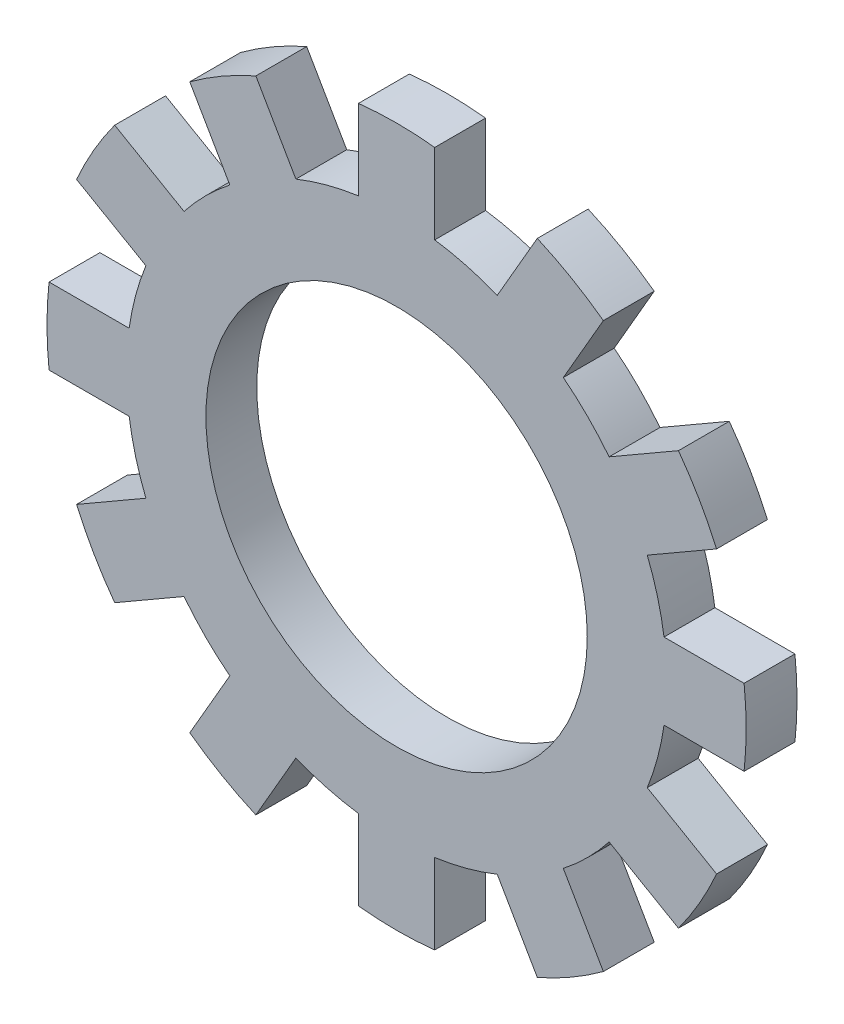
ISO-10303-21;
HEADER;
FILE_DESCRIPTION(('STEP AP214'),'2;1');
FILE_NAME('part.step','',(''),(''),'','','');
FILE_SCHEMA(('AUTOMOTIVE_DESIGN { 1 0 10303 214 1 1 1 1 }'));
ENDSEC;
DATA;
#1=APPLICATION_CONTEXT('core data for automotive mechanical design processes');
#2=APPLICATION_PROTOCOL_DEFINITION('international standard','automotive_design',2000,#1);
#3=PRODUCT_CONTEXT('',#1,'mechanical');
#4=PRODUCT('Part','Part','',(#3));
#5=PRODUCT_RELATED_PRODUCT_CATEGORY('part','',(#4));
#6=PRODUCT_DEFINITION_FORMATION('','',#4);
#7=PRODUCT_DEFINITION_CONTEXT('part definition',#1,'design');
#8=PRODUCT_DEFINITION('design','',#6,#7);
#9=PRODUCT_DEFINITION_SHAPE('','',#8);
#10=(LENGTH_UNIT() NAMED_UNIT(*) SI_UNIT(.MILLI.,.METRE.));
#11=(NAMED_UNIT(*) PLANE_ANGLE_UNIT() SI_UNIT($,.RADIAN.));
#12=(NAMED_UNIT(*) SI_UNIT($,.STERADIAN.) SOLID_ANGLE_UNIT());
#13=UNCERTAINTY_MEASURE_WITH_UNIT(LENGTH_MEASURE(1.E-05),#10,'distance_accuracy_value','');
#14=(GEOMETRIC_REPRESENTATION_CONTEXT(3) GLOBAL_UNCERTAINTY_ASSIGNED_CONTEXT((#13)) GLOBAL_UNIT_ASSIGNED_CONTEXT((#10,
#11,#12)) REPRESENTATION_CONTEXT('',''));
#15=CARTESIAN_POINT('',(0.,0.,0.));
#16=DIRECTION('',(0.,0.,1.));
#17=DIRECTION('',(1.,0.,0.));
#18=AXIS2_PLACEMENT_3D('',#15,#16,#17);
#19=CARTESIAN_POINT('',(0.,0.,0.2));
#20=DIRECTION('',(0.,0.,-1.));
#21=DIRECTION('',(-1.,0.,0.));
#22=AXIS2_PLACEMENT_3D('',#19,#20,#21);
#23=CYLINDRICAL_SURFACE('',#22,2.125);
#24=CARTESIAN_POINT('',(0.,0.,-0.2));
#25=DIRECTION('',(0.,0.,1.));
#26=DIRECTION('',(1.,0.,0.));
#27=AXIS2_PLACEMENT_3D('',#24,#25,#26);
#28=CIRCLE('',#27,2.125);
#29=CARTESIAN_POINT('',(1.6718723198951,1.31166609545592,-0.2));
#30=VERTEX_POINT('',#29);
#31=CARTESIAN_POINT('',(1.31166609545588,1.67187231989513,-0.2));
#32=VERTEX_POINT('',#31);
#33=EDGE_CURVE('E354',#30,#32,#28,.T.);
#34=ORIENTED_EDGE('',*,*,#33,.T.);
#35=DIRECTION('',(0.,0.,-1.));
#36=VECTOR('',#35,1.);
#37=CARTESIAN_POINT('',(1.31166609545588,1.67187231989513,0.2));
#38=LINE('',#37,#36);
#39=CARTESIAN_POINT('',(1.31166609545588,1.67187231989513,0.2));
#40=VERTEX_POINT('',#39);
#41=EDGE_CURVE('E346',#40,#32,#38,.T.);
#42=ORIENTED_EDGE('',*,*,#41,.F.);
#43=CARTESIAN_POINT('',(0.,0.,0.2));
#44=DIRECTION('',(0.,0.,1.));
#45=DIRECTION('',(1.,0.,0.));
#46=AXIS2_PLACEMENT_3D('',#43,#44,#45);
#47=CIRCLE('',#46,2.125);
#48=CARTESIAN_POINT('',(1.6718723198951,1.31166609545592,0.2));
#49=VERTEX_POINT('',#48);
#50=EDGE_CURVE('E58',#49,#40,#47,.T.);
#51=ORIENTED_EDGE('',*,*,#50,.F.);
#52=DIRECTION('',(0.,0.,-1.));
#53=VECTOR('',#52,1.);
#54=CARTESIAN_POINT('',(1.6718723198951,1.31166609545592,0.2));
#55=LINE('',#54,#53);
#56=EDGE_CURVE('E548',#49,#30,#55,.T.);
#57=ORIENTED_EDGE('',*,*,#56,.T.);
#58=EDGE_LOOP('',(#34,#42,#51,#57));
#59=FACE_BOUND('',#58,.T.);
#60=ADVANCED_FACE('F34',(#59),#23,.T.);
#61=DIRECTION('',(0.,0.,-1.));
#62=VECTOR('',#61,1.);
#63=CARTESIAN_POINT('',(0.792050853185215,1.97187231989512,0.2));
#64=LINE('',#63,#62);
#65=CARTESIAN_POINT('',(0.792050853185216,1.97187231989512,0.2));
#66=VERTEX_POINT('',#65);
#67=CARTESIAN_POINT('',(0.792050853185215,1.97187231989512,-0.2));
#68=VERTEX_POINT('',#67);
#69=EDGE_CURVE('E561',#66,#68,#64,.T.);
#70=ORIENTED_EDGE('',*,*,#69,.T.);
#71=CARTESIAN_POINT('',(0.299999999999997,2.10371694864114,-0.2));
#72=VERTEX_POINT('',#71);
#73=EDGE_CURVE('E373',#68,#72,#28,.T.);
#74=ORIENTED_EDGE('',*,*,#73,.T.);
#75=DIRECTION('',(0.,0.,-1.));
#76=VECTOR('',#75,1.);
#77=CARTESIAN_POINT('',(0.299999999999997,2.10371694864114,0.2));
#78=LINE('',#77,#76);
#79=CARTESIAN_POINT('',(0.299999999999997,2.10371694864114,0.2));
#80=VERTEX_POINT('',#79);
#81=EDGE_CURVE('E386',#80,#72,#78,.T.);
#82=ORIENTED_EDGE('',*,*,#81,.F.);
#83=EDGE_CURVE('E44',#66,#80,#47,.T.);
#84=ORIENTED_EDGE('',*,*,#83,.F.);
#85=EDGE_LOOP('',(#70,#74,#82,#84));
#86=FACE_BOUND('',#85,.T.);
#87=ADVANCED_FACE('F685',(#86),#23,.T.);
#88=CARTESIAN_POINT('',(2.10371694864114,0.300000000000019,-0.2));
#89=VERTEX_POINT('',#88);
#90=CARTESIAN_POINT('',(1.9718723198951,0.792050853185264,-0.2));
#91=VERTEX_POINT('',#90);
#92=EDGE_CURVE('E763',#89,#91,#28,.T.);
#93=ORIENTED_EDGE('',*,*,#92,.T.);
#94=DIRECTION('',(0.,0.,-1.));
#95=VECTOR('',#94,1.);
#96=CARTESIAN_POINT('',(1.9718723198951,0.792050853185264,0.2));
#97=LINE('',#96,#95);
#98=CARTESIAN_POINT('',(1.9718723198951,0.792050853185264,0.2));
#99=VERTEX_POINT('',#98);
#100=EDGE_CURVE('E661',#99,#91,#97,.T.);
#101=ORIENTED_EDGE('',*,*,#100,.F.);
#102=CARTESIAN_POINT('',(2.10371694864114,0.300000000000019,0.2));
#103=VERTEX_POINT('',#102);
#104=EDGE_CURVE('E362',#103,#99,#47,.T.);
#105=ORIENTED_EDGE('',*,*,#104,.F.);
#106=DIRECTION('',(0.,0.,-1.));
#107=VECTOR('',#106,1.);
#108=CARTESIAN_POINT('',(2.10371694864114,0.300000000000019,0.2));
#109=LINE('',#108,#107);
#110=EDGE_CURVE('E532',#103,#89,#109,.T.);
#111=ORIENTED_EDGE('',*,*,#110,.T.);
#112=EDGE_LOOP('',(#93,#101,#105,#111));
#113=FACE_BOUND('',#112,.T.);
#114=ADVANCED_FACE('F761',(#113),#23,.T.);
#115=CARTESIAN_POINT('',(1.97187231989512,-0.792050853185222,-0.2));
#116=VERTEX_POINT('',#115);
#117=CARTESIAN_POINT('',(2.10371694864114,-0.299999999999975,-0.2));
#118=VERTEX_POINT('',#117);
#119=EDGE_CURVE('E744',#116,#118,#28,.T.);
#120=ORIENTED_EDGE('',*,*,#119,.T.);
#121=DIRECTION('',(0.,0.,-1.));
#122=VECTOR('',#121,1.);
#123=CARTESIAN_POINT('',(2.10371694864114,-0.299999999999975,0.2));
#124=LINE('',#123,#122);
#125=CARTESIAN_POINT('',(2.10371694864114,-0.299999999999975,0.2));
#126=VERTEX_POINT('',#125);
#127=EDGE_CURVE('E651',#126,#118,#124,.T.);
#128=ORIENTED_EDGE('',*,*,#127,.F.);
#129=CARTESIAN_POINT('',(1.97187231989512,-0.792050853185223,0.2));
#130=VERTEX_POINT('',#129);
#131=EDGE_CURVE('E364',#130,#126,#47,.T.);
#132=ORIENTED_EDGE('',*,*,#131,.F.);
#133=DIRECTION('',(0.,0.,-1.));
#134=VECTOR('',#133,1.);
#135=CARTESIAN_POINT('',(1.97187231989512,-0.792050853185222,0.2));
#136=LINE('',#135,#134);
#137=EDGE_CURVE('E516',#130,#116,#136,.T.);
#138=ORIENTED_EDGE('',*,*,#137,.T.);
#139=EDGE_LOOP('',(#120,#128,#132,#138));
#140=FACE_BOUND('',#139,.T.);
#141=ADVANCED_FACE('F743',(#140),#23,.T.);
#142=CARTESIAN_POINT('',(1.31166609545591,-1.6718723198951,-0.2));
#143=VERTEX_POINT('',#142);
#144=CARTESIAN_POINT('',(1.67187231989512,-1.31166609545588,-0.2));
#145=VERTEX_POINT('',#144);
#146=EDGE_CURVE('E817',#143,#145,#28,.T.);
#147=ORIENTED_EDGE('',*,*,#146,.T.);
#148=DIRECTION('',(0.,0.,-1.));
#149=VECTOR('',#148,1.);
#150=CARTESIAN_POINT('',(1.67187231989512,-1.31166609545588,0.2));
#151=LINE('',#150,#149);
#152=CARTESIAN_POINT('',(1.67187231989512,-1.31166609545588,0.2));
#153=VERTEX_POINT('',#152);
#154=EDGE_CURVE('E641',#153,#145,#151,.T.);
#155=ORIENTED_EDGE('',*,*,#154,.F.);
#156=CARTESIAN_POINT('',(1.31166609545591,-1.6718723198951,0.2));
#157=VERTEX_POINT('',#156);
#158=EDGE_CURVE('E732',#157,#153,#47,.T.);
#159=ORIENTED_EDGE('',*,*,#158,.F.);
#160=DIRECTION('',(0.,0.,-1.));
#161=VECTOR('',#160,1.);
#162=CARTESIAN_POINT('',(1.31166609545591,-1.6718723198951,0.2));
#163=LINE('',#162,#161);
#164=EDGE_CURVE('E500',#157,#143,#163,.T.);
#165=ORIENTED_EDGE('',*,*,#164,.T.);
#166=EDGE_LOOP('',(#147,#155,#159,#165));
#167=FACE_BOUND('',#166,.T.);
#168=ADVANCED_FACE('F823',(#167),#23,.T.);
#169=CARTESIAN_POINT('',(0.299999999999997,-2.10371694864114,-0.2));
#170=VERTEX_POINT('',#169);
#171=CARTESIAN_POINT('',(0.792050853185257,-1.9718723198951,-0.2));
#172=VERTEX_POINT('',#171);
#173=EDGE_CURVE('E813',#170,#172,#28,.T.);
#174=ORIENTED_EDGE('',*,*,#173,.T.);
#175=DIRECTION('',(0.,0.,-1.));
#176=VECTOR('',#175,1.);
#177=CARTESIAN_POINT('',(0.792050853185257,-1.9718723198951,0.2));
#178=LINE('',#177,#176);
#179=CARTESIAN_POINT('',(0.792050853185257,-1.9718723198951,0.2));
#180=VERTEX_POINT('',#179);
#181=EDGE_CURVE('E631',#180,#172,#178,.T.);
#182=ORIENTED_EDGE('',*,*,#181,.F.);
#183=CARTESIAN_POINT('',(0.299999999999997,-2.10371694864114,0.2));
#184=VERTEX_POINT('',#183);
#185=EDGE_CURVE('E729',#184,#180,#47,.T.);
#186=ORIENTED_EDGE('',*,*,#185,.F.);
#187=DIRECTION('',(0.,0.,-1.));
#188=VECTOR('',#187,1.);
#189=CARTESIAN_POINT('',(0.299999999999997,-2.10371694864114,0.2));
#190=LINE('',#189,#188);
#191=EDGE_CURVE('E484',#184,#170,#190,.T.);
#192=ORIENTED_EDGE('',*,*,#191,.T.);
#193=EDGE_LOOP('',(#174,#182,#186,#192));
#194=FACE_BOUND('',#193,.T.);
#195=ADVANCED_FACE('F1142',(#194),#23,.T.);
#196=CARTESIAN_POINT('',(-0.792050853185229,-1.97187231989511,-0.2));
#197=VERTEX_POINT('',#196);
#198=CARTESIAN_POINT('',(-0.299999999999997,-2.10371694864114,-0.2));
#199=VERTEX_POINT('',#198);
#200=EDGE_CURVE('E809',#197,#199,#28,.T.);
#201=ORIENTED_EDGE('',*,*,#200,.T.);
#202=DIRECTION('',(0.,0.,-1.));
#203=VECTOR('',#202,1.);
#204=CARTESIAN_POINT('',(-0.299999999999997,-2.10371694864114,0.2));
#205=LINE('',#204,#203);
#206=CARTESIAN_POINT('',(-0.299999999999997,-2.10371694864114,0.2));
#207=VERTEX_POINT('',#206);
#208=EDGE_CURVE('E621',#207,#199,#205,.T.);
#209=ORIENTED_EDGE('',*,*,#208,.F.);
#210=CARTESIAN_POINT('',(-0.79205085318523,-1.97187231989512,0.2));
#211=VERTEX_POINT('',#210);
#212=EDGE_CURVE('E726',#211,#207,#47,.T.);
#213=ORIENTED_EDGE('',*,*,#212,.F.);
#214=DIRECTION('',(0.,0.,-1.));
#215=VECTOR('',#214,1.);
#216=CARTESIAN_POINT('',(-0.792050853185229,-1.97187231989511,0.2));
#217=LINE('',#216,#215);
#218=EDGE_CURVE('E468',#211,#197,#217,.T.);
#219=ORIENTED_EDGE('',*,*,#218,.T.);
#220=EDGE_LOOP('',(#201,#209,#213,#219));
#221=FACE_BOUND('',#220,.T.);
#222=ADVANCED_FACE('F1148',(#221),#23,.T.);
#223=CARTESIAN_POINT('',(-1.67187231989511,-1.31166609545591,-0.2));
#224=VERTEX_POINT('',#223);
#225=CARTESIAN_POINT('',(-1.31166609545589,-1.67187231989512,-0.2));
#226=VERTEX_POINT('',#225);
#227=EDGE_CURVE('E805',#224,#226,#28,.T.);
#228=ORIENTED_EDGE('',*,*,#227,.T.);
#229=DIRECTION('',(0.,0.,-1.));
#230=VECTOR('',#229,1.);
#231=CARTESIAN_POINT('',(-1.31166609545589,-1.67187231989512,0.2));
#232=LINE('',#231,#230);
#233=CARTESIAN_POINT('',(-1.31166609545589,-1.67187231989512,0.2));
#234=VERTEX_POINT('',#233);
#235=EDGE_CURVE('E611',#234,#226,#232,.T.);
#236=ORIENTED_EDGE('',*,*,#235,.F.);
#237=CARTESIAN_POINT('',(-1.67187231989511,-1.31166609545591,0.2));
#238=VERTEX_POINT('',#237);
#239=EDGE_CURVE('E723',#238,#234,#47,.T.);
#240=ORIENTED_EDGE('',*,*,#239,.F.);
#241=DIRECTION('',(0.,0.,-1.));
#242=VECTOR('',#241,1.);
#243=CARTESIAN_POINT('',(-1.67187231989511,-1.31166609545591,0.2));
#244=LINE('',#243,#242);
#245=EDGE_CURVE('E452',#238,#224,#244,.T.);
#246=ORIENTED_EDGE('',*,*,#245,.T.);
#247=EDGE_LOOP('',(#228,#236,#240,#246));
#248=FACE_BOUND('',#247,.T.);
#249=ADVANCED_FACE('F1155',(#248),#23,.T.);
#250=CARTESIAN_POINT('',(-2.10371694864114,-0.300000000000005,-0.2));
#251=VERTEX_POINT('',#250);
#252=CARTESIAN_POINT('',(-1.97187231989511,-0.79205085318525,-0.2));
#253=VERTEX_POINT('',#252);
#254=EDGE_CURVE('E802',#251,#253,#28,.T.);
#255=ORIENTED_EDGE('',*,*,#254,.T.);
#256=DIRECTION('',(0.,0.,-1.));
#257=VECTOR('',#256,1.);
#258=CARTESIAN_POINT('',(-1.97187231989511,-0.79205085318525,0.2));
#259=LINE('',#258,#257);
#260=CARTESIAN_POINT('',(-1.97187231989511,-0.79205085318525,0.2));
#261=VERTEX_POINT('',#260);
#262=EDGE_CURVE('E601',#261,#253,#259,.T.);
#263=ORIENTED_EDGE('',*,*,#262,.F.);
#264=CARTESIAN_POINT('',(-2.10371694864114,-0.300000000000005,0.2));
#265=VERTEX_POINT('',#264);
#266=EDGE_CURVE('E720',#265,#261,#47,.T.);
#267=ORIENTED_EDGE('',*,*,#266,.F.);
#268=DIRECTION('',(0.,0.,-1.));
#269=VECTOR('',#268,1.);
#270=CARTESIAN_POINT('',(-2.10371694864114,-0.300000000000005,0.2));
#271=LINE('',#270,#269);
#272=EDGE_CURVE('E436',#265,#251,#271,.T.);
#273=ORIENTED_EDGE('',*,*,#272,.T.);
#274=EDGE_LOOP('',(#255,#263,#267,#273));
#275=FACE_BOUND('',#274,.T.);
#276=ADVANCED_FACE('F796',(#275),#23,.T.);
#277=CARTESIAN_POINT('',(-1.97187231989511,0.792050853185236,-0.2));
#278=VERTEX_POINT('',#277);
#279=CARTESIAN_POINT('',(-2.10371694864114,0.29999999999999,-0.2));
#280=VERTEX_POINT('',#279);
#281=EDGE_CURVE('E800',#278,#280,#28,.T.);
#282=ORIENTED_EDGE('',*,*,#281,.T.);
#283=DIRECTION('',(0.,0.,-1.));
#284=VECTOR('',#283,1.);
#285=CARTESIAN_POINT('',(-2.10371694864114,0.29999999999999,0.2));
#286=LINE('',#285,#284);
#287=CARTESIAN_POINT('',(-2.10371694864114,0.29999999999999,0.2));
#288=VERTEX_POINT('',#287);
#289=EDGE_CURVE('E591',#288,#280,#286,.T.);
#290=ORIENTED_EDGE('',*,*,#289,.F.);
#291=CARTESIAN_POINT('',(-1.97187231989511,0.792050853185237,0.2));
#292=VERTEX_POINT('',#291);
#293=EDGE_CURVE('E718',#292,#288,#47,.T.);
#294=ORIENTED_EDGE('',*,*,#293,.F.);
#295=DIRECTION('',(0.,0.,-1.));
#296=VECTOR('',#295,1.);
#297=CARTESIAN_POINT('',(-1.97187231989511,0.792050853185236,0.2));
#298=LINE('',#297,#296);
#299=EDGE_CURVE('E420',#292,#278,#298,.T.);
#300=ORIENTED_EDGE('',*,*,#299,.T.);
#301=EDGE_LOOP('',(#282,#290,#294,#300));
#302=FACE_BOUND('',#301,.T.);
#303=ADVANCED_FACE('F792',(#302),#23,.T.);
#304=CARTESIAN_POINT('',(-1.3116660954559,1.67187231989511,-0.2));
#305=VERTEX_POINT('',#304);
#306=CARTESIAN_POINT('',(-1.67187231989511,1.3116660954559,-0.2));
#307=VERTEX_POINT('',#306);
#308=EDGE_CURVE('E799',#305,#307,#28,.T.);
#309=ORIENTED_EDGE('',*,*,#308,.T.);
#310=DIRECTION('',(0.,0.,-1.));
#311=VECTOR('',#310,1.);
#312=CARTESIAN_POINT('',(-1.67187231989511,1.3116660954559,0.2));
#313=LINE('',#312,#311);
#314=CARTESIAN_POINT('',(-1.67187231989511,1.3116660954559,0.2));
#315=VERTEX_POINT('',#314);
#316=EDGE_CURVE('E581',#315,#307,#313,.T.);
#317=ORIENTED_EDGE('',*,*,#316,.F.);
#318=CARTESIAN_POINT('',(-1.3116660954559,1.67187231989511,0.2));
#319=VERTEX_POINT('',#318);
#320=EDGE_CURVE('E43',#319,#315,#47,.T.);
#321=ORIENTED_EDGE('',*,*,#320,.F.);
#322=DIRECTION('',(0.,0.,-1.));
#323=VECTOR('',#322,1.);
#324=CARTESIAN_POINT('',(-1.3116660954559,1.67187231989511,0.2));
#325=LINE('',#324,#323);
#326=EDGE_CURVE('E404',#319,#305,#325,.T.);
#327=ORIENTED_EDGE('',*,*,#326,.T.);
#328=EDGE_LOOP('',(#309,#317,#321,#327));
#329=FACE_BOUND('',#328,.T.);
#330=ADVANCED_FACE('F786',(#329),#23,.T.);
#331=CARTESIAN_POINT('',(-0.299999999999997,2.10371694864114,-0.2));
#332=VERTEX_POINT('',#331);
#333=CARTESIAN_POINT('',(-0.792050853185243,1.97187231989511,-0.2));
#334=VERTEX_POINT('',#333);
#335=EDGE_CURVE('E38',#332,#334,#28,.T.);
#336=ORIENTED_EDGE('',*,*,#335,.T.);
#337=DIRECTION('',(0.,0.,-1.));
#338=VECTOR('',#337,1.);
#339=CARTESIAN_POINT('',(-0.792050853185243,1.97187231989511,0.2));
#340=LINE('',#339,#338);
#341=CARTESIAN_POINT('',(-0.792050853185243,1.97187231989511,0.2));
#342=VERTEX_POINT('',#341);
#343=EDGE_CURVE('E570',#342,#334,#340,.T.);
#344=ORIENTED_EDGE('',*,*,#343,.F.);
#345=CARTESIAN_POINT('',(-0.299999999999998,2.10371694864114,0.2));
#346=VERTEX_POINT('',#345);
#347=EDGE_CURVE('E11',#346,#342,#47,.T.);
#348=ORIENTED_EDGE('',*,*,#347,.F.);
#349=DIRECTION('',(0.,0.,-1.));
#350=VECTOR('',#349,1.);
#351=CARTESIAN_POINT('',(-0.299999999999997,2.10371694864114,0.2));
#352=LINE('',#351,#350);
#353=EDGE_CURVE('E376',#346,#332,#352,.T.);
#354=ORIENTED_EDGE('',*,*,#353,.T.);
#355=EDGE_LOOP('',(#336,#344,#348,#354));
#356=FACE_BOUND('',#355,.T.);
#357=ADVANCED_FACE('F36',(#356),#23,.T.);
#358=CARTESIAN_POINT('',(0.,0.,0.2));
#359=DIRECTION('',(0.,0.,1.));
#360=DIRECTION('',(1.,0.,0.));
#361=AXIS2_PLACEMENT_3D('',#358,#359,#360);
#362=PLANE('',#361);
#363=ORIENTED_EDGE('',*,*,#347,.T.);
#364=DIRECTION('',(0.500000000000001,-0.866025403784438,0.));
#365=VECTOR('',#364,1.);
#366=CARTESIAN_POINT('',(-1.10698607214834,2.51735612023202,0.2));
#367=LINE('',#366,#365);
#368=CARTESIAN_POINT('',(-1.10698607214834,2.51735612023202,0.2));
#369=VERTEX_POINT('',#368);
#370=EDGE_CURVE('E577',#369,#342,#367,.T.);
#371=ORIENTED_EDGE('',*,*,#370,.F.);
#372=CARTESIAN_POINT('',(0.,0.,0.2));
#373=DIRECTION('',(0.,0.,1.));
#374=DIRECTION('',(0.866025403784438,0.500000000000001,0.));
#375=AXIS2_PLACEMENT_3D('',#372,#373,#374);
#376=CIRCLE('',#375,2.75);
#377=CARTESIAN_POINT('',(-1.626601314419,2.21735612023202,0.2));
#378=VERTEX_POINT('',#377);
#379=EDGE_CURVE('E411',#369,#378,#376,.T.);
#380=ORIENTED_EDGE('',*,*,#379,.T.);
#381=DIRECTION('',(0.500000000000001,-0.866025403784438,0.));
#382=VECTOR('',#381,1.);
#383=CARTESIAN_POINT('',(-1.626601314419,2.21735612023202,0.2));
#384=LINE('',#383,#382);
#385=EDGE_CURVE('E407',#378,#319,#384,.T.);
#386=ORIENTED_EDGE('',*,*,#385,.T.);
#387=ORIENTED_EDGE('',*,*,#320,.T.);
#388=DIRECTION('',(0.86602540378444,-0.499999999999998,0.));
#389=VECTOR('',#388,1.);
#390=CARTESIAN_POINT('',(-2.21735612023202,1.62660131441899,0.2));
#391=LINE('',#390,#389);
#392=CARTESIAN_POINT('',(-2.21735612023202,1.62660131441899,0.2));
#393=VERTEX_POINT('',#392);
#394=EDGE_CURVE('E587',#393,#315,#391,.T.);
#395=ORIENTED_EDGE('',*,*,#394,.F.);
#396=CARTESIAN_POINT('',(0.,0.,0.2));
#397=DIRECTION('',(0.,0.,1.));
#398=DIRECTION('',(0.499999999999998,0.86602540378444,0.));
#399=AXIS2_PLACEMENT_3D('',#396,#397,#398);
#400=CIRCLE('',#399,2.75);
#401=CARTESIAN_POINT('',(-2.51735612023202,1.10698607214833,0.2));
#402=VERTEX_POINT('',#401);
#403=EDGE_CURVE('E427',#393,#402,#400,.T.);
#404=ORIENTED_EDGE('',*,*,#403,.T.);
#405=DIRECTION('',(0.86602540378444,-0.499999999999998,0.));
#406=VECTOR('',#405,1.);
#407=CARTESIAN_POINT('',(-2.51735612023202,1.10698607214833,0.2));
#408=LINE('',#407,#406);
#409=EDGE_CURVE('E423',#402,#292,#408,.T.);
#410=ORIENTED_EDGE('',*,*,#409,.T.);
#411=ORIENTED_EDGE('',*,*,#293,.T.);
#412=DIRECTION('',(1.,0.,0.));
#413=VECTOR('',#412,1.);
#414=CARTESIAN_POINT('',(-2.73358738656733,0.299999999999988,0.2));
#415=LINE('',#414,#413);
#416=CARTESIAN_POINT('',(-2.73358738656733,0.299999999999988,0.2));
#417=VERTEX_POINT('',#416);
#418=EDGE_CURVE('E597',#417,#288,#415,.T.);
#419=ORIENTED_EDGE('',*,*,#418,.F.);
#420=CARTESIAN_POINT('',(0.,0.,0.2));
#421=DIRECTION('',(0.,0.,1.));
#422=DIRECTION('',(0.,1.,0.));
#423=AXIS2_PLACEMENT_3D('',#420,#421,#422);
#424=CIRCLE('',#423,2.75);
#425=CARTESIAN_POINT('',(-2.73358738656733,-0.300000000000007,0.2));
#426=VERTEX_POINT('',#425);
#427=EDGE_CURVE('E443',#417,#426,#424,.T.);
#428=ORIENTED_EDGE('',*,*,#427,.T.);
#429=DIRECTION('',(1.,0.,0.));
#430=VECTOR('',#429,1.);
#431=CARTESIAN_POINT('',(-2.73358738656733,-0.300000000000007,0.2));
#432=LINE('',#431,#430);
#433=EDGE_CURVE('E439',#426,#265,#432,.T.);
#434=ORIENTED_EDGE('',*,*,#433,.T.);
#435=ORIENTED_EDGE('',*,*,#266,.T.);
#436=DIRECTION('',(0.866025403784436,0.500000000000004,0.));
#437=VECTOR('',#436,1.);
#438=CARTESIAN_POINT('',(-2.51735612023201,-1.10698607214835,0.2));
#439=LINE('',#438,#437);
#440=CARTESIAN_POINT('',(-2.51735612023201,-1.10698607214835,0.2));
#441=VERTEX_POINT('',#440);
#442=EDGE_CURVE('E607',#441,#261,#439,.T.);
#443=ORIENTED_EDGE('',*,*,#442,.F.);
#444=CARTESIAN_POINT('',(0.,0.,0.2));
#445=DIRECTION('',(0.,0.,1.));
#446=DIRECTION('',(-0.500000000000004,0.866025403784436,0.));
#447=AXIS2_PLACEMENT_3D('',#444,#445,#446);
#448=CIRCLE('',#447,2.75);
#449=CARTESIAN_POINT('',(-2.21735612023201,-1.626601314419,0.2));
#450=VERTEX_POINT('',#449);
#451=EDGE_CURVE('E459',#441,#450,#448,.T.);
#452=ORIENTED_EDGE('',*,*,#451,.T.);
#453=DIRECTION('',(0.866025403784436,0.500000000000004,0.));
#454=VECTOR('',#453,1.);
#455=CARTESIAN_POINT('',(-2.21735612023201,-1.626601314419,0.2));
#456=LINE('',#455,#454);
#457=EDGE_CURVE('E455',#450,#238,#456,.T.);
#458=ORIENTED_EDGE('',*,*,#457,.T.);
#459=ORIENTED_EDGE('',*,*,#239,.T.);
#460=DIRECTION('',(0.499999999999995,0.866025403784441,0.));
#461=VECTOR('',#460,1.);
#462=CARTESIAN_POINT('',(-1.62660131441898,-2.21735612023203,0.2));
#463=LINE('',#462,#461);
#464=CARTESIAN_POINT('',(-1.62660131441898,-2.21735612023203,0.2));
#465=VERTEX_POINT('',#464);
#466=EDGE_CURVE('E617',#465,#234,#463,.T.);
#467=ORIENTED_EDGE('',*,*,#466,.F.);
#468=CARTESIAN_POINT('',(0.,0.,0.2));
#469=DIRECTION('',(0.,0.,1.));
#470=DIRECTION('',(-0.866025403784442,0.499999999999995,0.));
#471=AXIS2_PLACEMENT_3D('',#468,#469,#470);
#472=CIRCLE('',#471,2.75);
#473=CARTESIAN_POINT('',(-1.10698607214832,-2.51735612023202,0.2));
#474=VERTEX_POINT('',#473);
#475=EDGE_CURVE('E475',#465,#474,#472,.T.);
#476=ORIENTED_EDGE('',*,*,#475,.T.);
#477=DIRECTION('',(0.499999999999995,0.866025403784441,0.));
#478=VECTOR('',#477,1.);
#479=CARTESIAN_POINT('',(-1.10698607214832,-2.51735612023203,0.2));
#480=LINE('',#479,#478);
#481=EDGE_CURVE('E471',#474,#211,#480,.T.);
#482=ORIENTED_EDGE('',*,*,#481,.T.);
#483=ORIENTED_EDGE('',*,*,#212,.T.);
#484=DIRECTION('',(0.,1.,0.));
#485=VECTOR('',#484,1.);
#486=CARTESIAN_POINT('',(-0.299999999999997,-2.73358738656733,0.2));
#487=LINE('',#486,#485);
#488=CARTESIAN_POINT('',(-0.299999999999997,-2.73358738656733,0.2));
#489=VERTEX_POINT('',#488);
#490=EDGE_CURVE('E627',#489,#207,#487,.T.);
#491=ORIENTED_EDGE('',*,*,#490,.F.);
#492=CARTESIAN_POINT('',(0.,0.,0.2));
#493=DIRECTION('',(0.,0.,1.));
#494=DIRECTION('',(-1.,0.,0.));
#495=AXIS2_PLACEMENT_3D('',#492,#493,#494);
#496=CIRCLE('',#495,2.75);
#497=CARTESIAN_POINT('',(0.299999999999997,-2.73358738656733,0.2));
#498=VERTEX_POINT('',#497);
#499=EDGE_CURVE('E491',#489,#498,#496,.T.);
#500=ORIENTED_EDGE('',*,*,#499,.T.);
#501=DIRECTION('',(0.,1.,0.));
#502=VECTOR('',#501,1.);
#503=CARTESIAN_POINT('',(0.299999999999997,-2.73358738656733,0.2));
#504=LINE('',#503,#502);
#505=EDGE_CURVE('E487',#498,#184,#504,.T.);
#506=ORIENTED_EDGE('',*,*,#505,.T.);
#507=ORIENTED_EDGE('',*,*,#185,.T.);
#508=DIRECTION('',(-0.500000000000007,0.866025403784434,0.));
#509=VECTOR('',#508,1.);
#510=CARTESIAN_POINT('',(1.10698607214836,-2.51735612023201,0.2));
#511=LINE('',#510,#509);
#512=CARTESIAN_POINT('',(1.10698607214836,-2.51735612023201,0.2));
#513=VERTEX_POINT('',#512);
#514=EDGE_CURVE('E637',#513,#180,#511,.T.);
#515=ORIENTED_EDGE('',*,*,#514,.F.);
#516=CARTESIAN_POINT('',(0.,0.,0.2));
#517=DIRECTION('',(0.,0.,1.));
#518=DIRECTION('',(-0.866025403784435,-0.500000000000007,0.));
#519=AXIS2_PLACEMENT_3D('',#516,#517,#518);
#520=CIRCLE('',#519,2.75);
#521=CARTESIAN_POINT('',(1.62660131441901,-2.21735612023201,0.2));
#522=VERTEX_POINT('',#521);
#523=EDGE_CURVE('E507',#513,#522,#520,.T.);
#524=ORIENTED_EDGE('',*,*,#523,.T.);
#525=DIRECTION('',(-0.500000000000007,0.866025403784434,0.));
#526=VECTOR('',#525,1.);
#527=CARTESIAN_POINT('',(1.62660131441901,-2.21735612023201,0.2));
#528=LINE('',#527,#526);
#529=EDGE_CURVE('E503',#522,#157,#528,.T.);
#530=ORIENTED_EDGE('',*,*,#529,.T.);
#531=ORIENTED_EDGE('',*,*,#158,.T.);
#532=DIRECTION('',(-0.866025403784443,0.499999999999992,0.));
#533=VECTOR('',#532,1.);
#534=CARTESIAN_POINT('',(2.21735612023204,-1.62660131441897,0.2));
#535=LINE('',#534,#533);
#536=CARTESIAN_POINT('',(2.21735612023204,-1.62660131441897,0.2));
#537=VERTEX_POINT('',#536);
#538=EDGE_CURVE('E647',#537,#153,#535,.T.);
#539=ORIENTED_EDGE('',*,*,#538,.F.);
#540=CARTESIAN_POINT('',(0.,0.,0.2));
#541=DIRECTION('',(0.,0.,1.));
#542=DIRECTION('',(-0.499999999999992,-0.866025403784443,0.));
#543=AXIS2_PLACEMENT_3D('',#540,#541,#542);
#544=CIRCLE('',#543,2.75);
#545=CARTESIAN_POINT('',(2.51735612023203,-1.10698607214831,0.2));
#546=VERTEX_POINT('',#545);
#547=EDGE_CURVE('E523',#537,#546,#544,.T.);
#548=ORIENTED_EDGE('',*,*,#547,.T.);
#549=DIRECTION('',(-0.866025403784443,0.499999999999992,0.));
#550=VECTOR('',#549,1.);
#551=CARTESIAN_POINT('',(2.51735612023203,-1.10698607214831,0.2));
#552=LINE('',#551,#550);
#553=EDGE_CURVE('E519',#546,#130,#552,.T.);
#554=ORIENTED_EDGE('',*,*,#553,.T.);
#555=ORIENTED_EDGE('',*,*,#131,.T.);
#556=DIRECTION('',(-1.,0.,0.));
#557=VECTOR('',#556,1.);
#558=CARTESIAN_POINT('',(2.73358738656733,-0.299999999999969,0.2));
#559=LINE('',#558,#557);
#560=CARTESIAN_POINT('',(2.73358738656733,-0.299999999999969,0.2));
#561=VERTEX_POINT('',#560);
#562=EDGE_CURVE('E657',#561,#126,#559,.T.);
#563=ORIENTED_EDGE('',*,*,#562,.F.);
#564=CARTESIAN_POINT('',(0.,0.,0.2));
#565=DIRECTION('',(0.,0.,1.));
#566=DIRECTION('',(0.,-1.,0.));
#567=AXIS2_PLACEMENT_3D('',#564,#565,#566);
#568=CIRCLE('',#567,2.75);
#569=CARTESIAN_POINT('',(2.73358738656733,0.300000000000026,0.2));
#570=VERTEX_POINT('',#569);
#571=EDGE_CURVE('E539',#561,#570,#568,.T.);
#572=ORIENTED_EDGE('',*,*,#571,.T.);
#573=DIRECTION('',(-1.,0.,0.));
#574=VECTOR('',#573,1.);
#575=CARTESIAN_POINT('',(2.73358738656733,0.300000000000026,0.2));
#576=LINE('',#575,#574);
#577=EDGE_CURVE('E535',#570,#103,#576,.T.);
#578=ORIENTED_EDGE('',*,*,#577,.T.);
#579=ORIENTED_EDGE('',*,*,#104,.T.);
#580=DIRECTION('',(-0.866025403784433,-0.50000000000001,0.));
#581=VECTOR('',#580,1.);
#582=CARTESIAN_POINT('',(2.51735612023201,1.10698607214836,0.2));
#583=LINE('',#582,#581);
#584=CARTESIAN_POINT('',(2.51735612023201,1.10698607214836,0.2));
#585=VERTEX_POINT('',#584);
#586=EDGE_CURVE('E667',#585,#99,#583,.T.);
#587=ORIENTED_EDGE('',*,*,#586,.F.);
#588=CARTESIAN_POINT('',(0.,0.,0.2));
#589=DIRECTION('',(0.,0.,1.));
#590=DIRECTION('',(0.50000000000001,-0.866025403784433,0.));
#591=AXIS2_PLACEMENT_3D('',#588,#589,#590);
#592=CIRCLE('',#591,2.75);
#593=CARTESIAN_POINT('',(2.217356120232,1.62660131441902,0.2));
#594=VERTEX_POINT('',#593);
#595=EDGE_CURVE('E553',#585,#594,#592,.T.);
#596=ORIENTED_EDGE('',*,*,#595,.T.);
#597=DIRECTION('',(-0.866025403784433,-0.50000000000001,0.));
#598=VECTOR('',#597,1.);
#599=CARTESIAN_POINT('',(2.217356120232,1.62660131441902,0.2));
#600=LINE('',#599,#598);
#601=EDGE_CURVE('E360',#594,#49,#600,.T.);
#602=ORIENTED_EDGE('',*,*,#601,.T.);
#603=ORIENTED_EDGE('',*,*,#50,.T.);
#604=DIRECTION('',(-0.499999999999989,-0.866025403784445,0.));
#605=VECTOR('',#604,1.);
#606=CARTESIAN_POINT('',(1.62660131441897,2.21735612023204,0.2));
#607=LINE('',#606,#605);
#608=CARTESIAN_POINT('',(1.62660131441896,2.21735612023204,0.2));
#609=VERTEX_POINT('',#608);
#610=EDGE_CURVE('E343',#609,#40,#607,.T.);
#611=ORIENTED_EDGE('',*,*,#610,.F.);
#612=CARTESIAN_POINT('',(0.,0.,0.2));
#613=DIRECTION('',(0.,0.,1.));
#614=DIRECTION('',(0.866025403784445,-0.499999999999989,0.));
#615=AXIS2_PLACEMENT_3D('',#612,#613,#614);
#616=CIRCLE('',#615,2.75);
#617=CARTESIAN_POINT('',(1.1069860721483,2.51735612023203,0.2));
#618=VERTEX_POINT('',#617);
#619=EDGE_CURVE('E567',#609,#618,#616,.T.);
#620=ORIENTED_EDGE('',*,*,#619,.T.);
#621=DIRECTION('',(-0.499999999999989,-0.866025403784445,0.));
#622=VECTOR('',#621,1.);
#623=CARTESIAN_POINT('',(1.1069860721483,2.51735612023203,0.2));
#624=LINE('',#623,#622);
#625=EDGE_CURVE('E563',#618,#66,#624,.T.);
#626=ORIENTED_EDGE('',*,*,#625,.T.);
#627=ORIENTED_EDGE('',*,*,#83,.T.);
#628=DIRECTION('',(0.,-1.,0.));
#629=VECTOR('',#628,1.);
#630=CARTESIAN_POINT('',(0.299999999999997,2.73358738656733,0.2));
#631=LINE('',#630,#629);
#632=CARTESIAN_POINT('',(0.299999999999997,2.73358738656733,0.2));
#633=VERTEX_POINT('',#632);
#634=EDGE_CURVE('E395',#633,#80,#631,.T.);
#635=ORIENTED_EDGE('',*,*,#634,.F.);
#636=CARTESIAN_POINT('',(0.,0.,0.2));
#637=DIRECTION('',(0.,0.,1.));
#638=DIRECTION('',(1.,0.,0.));
#639=AXIS2_PLACEMENT_3D('',#636,#637,#638);
#640=CIRCLE('',#639,2.75);
#641=CARTESIAN_POINT('',(-0.299999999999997,2.73358738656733,0.2));
#642=VERTEX_POINT('',#641);
#643=EDGE_CURVE('E383',#633,#642,#640,.T.);
#644=ORIENTED_EDGE('',*,*,#643,.T.);
#645=DIRECTION('',(0.,-1.,0.));
#646=VECTOR('',#645,1.);
#647=CARTESIAN_POINT('',(-0.299999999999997,2.73358738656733,0.2));
#648=LINE('',#647,#646);
#649=EDGE_CURVE('E379',#642,#346,#648,.T.);
#650=ORIENTED_EDGE('',*,*,#649,.T.);
#651=EDGE_LOOP('',(#363,#371,#380,#386,#387,#395,#404,#410,#411,#419,#428,#434,#435,#443,#452,
#458,#459,#467,#476,#482,#483,#491,#500,#506,#507,#515,#524,#530,#531,#539,#548,#554,#555,#563,
#572,#578,#579,#587,#596,#602,#603,#611,#620,#626,#627,#635,#644,#650));
#652=FACE_BOUND('',#651,.T.);
#653=CARTESIAN_POINT('',(0.,0.,0.2));
#654=DIRECTION('',(0.,0.,1.));
#655=DIRECTION('',(1.,0.,0.));
#656=AXIS2_PLACEMENT_3D('',#653,#654,#655);
#657=CIRCLE('',#656,1.5);
#658=CARTESIAN_POINT('',(1.5,0.,0.2));
#659=VERTEX_POINT('',#658);
#660=EDGE_CURVE('E369',#659,#659,#657,.T.);
#661=ORIENTED_EDGE('',*,*,#660,.F.);
#662=EDGE_LOOP('',(#661));
#663=FACE_BOUND('',#662,.T.);
#664=ADVANCED_FACE('F357',(#652,#663),#362,.T.);
#665=CARTESIAN_POINT('',(0.,0.,-0.2));
#666=DIRECTION('',(0.,0.,1.));
#667=DIRECTION('',(1.,0.,0.));
#668=AXIS2_PLACEMENT_3D('',#665,#666,#667);
#669=PLANE('',#668);
#670=ORIENTED_EDGE('',*,*,#335,.F.);
#671=DIRECTION('',(0.,-1.,0.));
#672=VECTOR('',#671,1.);
#673=CARTESIAN_POINT('',(-0.299999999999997,2.73358738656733,-0.2));
#674=LINE('',#673,#672);
#675=CARTESIAN_POINT('',(-0.299999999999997,2.73358738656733,-0.2));
#676=VERTEX_POINT('',#675);
#677=EDGE_CURVE('E380',#676,#332,#674,.T.);
#678=ORIENTED_EDGE('',*,*,#677,.F.);
#679=CARTESIAN_POINT('',(0.,0.,-0.2));
#680=DIRECTION('',(0.,0.,1.));
#681=DIRECTION('',(1.,0.,0.));
#682=AXIS2_PLACEMENT_3D('',#679,#680,#681);
#683=CIRCLE('',#682,2.75);
#684=CARTESIAN_POINT('',(0.299999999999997,2.73358738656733,-0.2));
#685=VERTEX_POINT('',#684);
#686=EDGE_CURVE('E384',#685,#676,#683,.T.);
#687=ORIENTED_EDGE('',*,*,#686,.F.);
#688=DIRECTION('',(0.,-1.,0.));
#689=VECTOR('',#688,1.);
#690=CARTESIAN_POINT('',(0.299999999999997,2.73358738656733,-0.2));
#691=LINE('',#690,#689);
#692=EDGE_CURVE('E396',#685,#72,#691,.T.);
#693=ORIENTED_EDGE('',*,*,#692,.T.);
#694=ORIENTED_EDGE('',*,*,#73,.F.);
#695=DIRECTION('',(-0.499999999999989,-0.866025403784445,0.));
#696=VECTOR('',#695,1.);
#697=CARTESIAN_POINT('',(1.1069860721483,2.51735612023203,-0.2));
#698=LINE('',#697,#696);
#699=CARTESIAN_POINT('',(1.1069860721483,2.51735612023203,-0.2));
#700=VERTEX_POINT('',#699);
#701=EDGE_CURVE('E564',#700,#68,#698,.T.);
#702=ORIENTED_EDGE('',*,*,#701,.F.);
#703=CARTESIAN_POINT('',(0.,0.,-0.2));
#704=DIRECTION('',(0.,0.,1.));
#705=DIRECTION('',(0.866025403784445,-0.499999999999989,0.));
#706=AXIS2_PLACEMENT_3D('',#703,#704,#705);
#707=CIRCLE('',#706,2.75);
#708=CARTESIAN_POINT('',(1.62660131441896,2.21735612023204,-0.2));
#709=VERTEX_POINT('',#708);
#710=EDGE_CURVE('E568',#709,#700,#707,.T.);
#711=ORIENTED_EDGE('',*,*,#710,.F.);
#712=DIRECTION('',(-0.499999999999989,-0.866025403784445,0.));
#713=VECTOR('',#712,1.);
#714=CARTESIAN_POINT('',(1.62660131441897,2.21735612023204,-0.2));
#715=LINE('',#714,#713);
#716=EDGE_CURVE('E351',#709,#32,#715,.T.);
#717=ORIENTED_EDGE('',*,*,#716,.T.);
#718=ORIENTED_EDGE('',*,*,#33,.F.);
#719=DIRECTION('',(-0.866025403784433,-0.50000000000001,0.));
#720=VECTOR('',#719,1.);
#721=CARTESIAN_POINT('',(2.217356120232,1.62660131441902,-0.2));
#722=LINE('',#721,#720);
#723=CARTESIAN_POINT('',(2.217356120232,1.62660131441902,-0.2));
#724=VERTEX_POINT('',#723);
#725=EDGE_CURVE('E550',#724,#30,#722,.T.);
#726=ORIENTED_EDGE('',*,*,#725,.F.);
#727=CARTESIAN_POINT('',(0.,0.,-0.2));
#728=DIRECTION('',(0.,0.,1.));
#729=DIRECTION('',(0.50000000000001,-0.866025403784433,0.));
#730=AXIS2_PLACEMENT_3D('',#727,#728,#729);
#731=CIRCLE('',#730,2.75);
#732=CARTESIAN_POINT('',(2.51735612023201,1.10698607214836,-0.2));
#733=VERTEX_POINT('',#732);
#734=EDGE_CURVE('E554',#733,#724,#731,.T.);
#735=ORIENTED_EDGE('',*,*,#734,.F.);
#736=DIRECTION('',(-0.866025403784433,-0.50000000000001,0.));
#737=VECTOR('',#736,1.);
#738=CARTESIAN_POINT('',(2.51735612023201,1.10698607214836,-0.2));
#739=LINE('',#738,#737);
#740=EDGE_CURVE('E355',#733,#91,#739,.T.);
#741=ORIENTED_EDGE('',*,*,#740,.T.);
#742=ORIENTED_EDGE('',*,*,#92,.F.);
#743=DIRECTION('',(-1.,0.,0.));
#744=VECTOR('',#743,1.);
#745=CARTESIAN_POINT('',(2.73358738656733,0.300000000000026,-0.2));
#746=LINE('',#745,#744);
#747=CARTESIAN_POINT('',(2.73358738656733,0.300000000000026,-0.2));
#748=VERTEX_POINT('',#747);
#749=EDGE_CURVE('E536',#748,#89,#746,.T.);
#750=ORIENTED_EDGE('',*,*,#749,.F.);
#751=CARTESIAN_POINT('',(0.,0.,-0.2));
#752=DIRECTION('',(0.,0.,1.));
#753=DIRECTION('',(0.,-1.,0.));
#754=AXIS2_PLACEMENT_3D('',#751,#752,#753);
#755=CIRCLE('',#754,2.75);
#756=CARTESIAN_POINT('',(2.73358738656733,-0.299999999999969,-0.2));
#757=VERTEX_POINT('',#756);
#758=EDGE_CURVE('E540',#757,#748,#755,.T.);
#759=ORIENTED_EDGE('',*,*,#758,.F.);
#760=DIRECTION('',(-1.,0.,0.));
#761=VECTOR('',#760,1.);
#762=CARTESIAN_POINT('',(2.73358738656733,-0.299999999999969,-0.2));
#763=LINE('',#762,#761);
#764=EDGE_CURVE('E658',#757,#118,#763,.T.);
#765=ORIENTED_EDGE('',*,*,#764,.T.);
#766=ORIENTED_EDGE('',*,*,#119,.F.);
#767=DIRECTION('',(-0.866025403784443,0.499999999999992,0.));
#768=VECTOR('',#767,1.);
#769=CARTESIAN_POINT('',(2.51735612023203,-1.10698607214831,-0.2));
#770=LINE('',#769,#768);
#771=CARTESIAN_POINT('',(2.51735612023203,-1.10698607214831,-0.2));
#772=VERTEX_POINT('',#771);
#773=EDGE_CURVE('E520',#772,#116,#770,.T.);
#774=ORIENTED_EDGE('',*,*,#773,.F.);
#775=CARTESIAN_POINT('',(0.,0.,-0.2));
#776=DIRECTION('',(0.,0.,1.));
#777=DIRECTION('',(-0.499999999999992,-0.866025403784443,0.));
#778=AXIS2_PLACEMENT_3D('',#775,#776,#777);
#779=CIRCLE('',#778,2.75);
#780=CARTESIAN_POINT('',(2.21735612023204,-1.62660131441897,-0.2));
#781=VERTEX_POINT('',#780);
#782=EDGE_CURVE('E524',#781,#772,#779,.T.);
#783=ORIENTED_EDGE('',*,*,#782,.F.);
#784=DIRECTION('',(-0.866025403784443,0.499999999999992,0.));
#785=VECTOR('',#784,1.);
#786=CARTESIAN_POINT('',(2.21735612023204,-1.62660131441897,-0.2));
#787=LINE('',#786,#785);
#788=EDGE_CURVE('E648',#781,#145,#787,.T.);
#789=ORIENTED_EDGE('',*,*,#788,.T.);
#790=ORIENTED_EDGE('',*,*,#146,.F.);
#791=DIRECTION('',(-0.500000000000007,0.866025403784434,0.));
#792=VECTOR('',#791,1.);
#793=CARTESIAN_POINT('',(1.62660131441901,-2.21735612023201,-0.2));
#794=LINE('',#793,#792);
#795=CARTESIAN_POINT('',(1.62660131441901,-2.21735612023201,-0.2));
#796=VERTEX_POINT('',#795);
#797=EDGE_CURVE('E504',#796,#143,#794,.T.);
#798=ORIENTED_EDGE('',*,*,#797,.F.);
#799=CARTESIAN_POINT('',(0.,0.,-0.2));
#800=DIRECTION('',(0.,0.,1.));
#801=DIRECTION('',(-0.866025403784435,-0.500000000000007,0.));
#802=AXIS2_PLACEMENT_3D('',#799,#800,#801);
#803=CIRCLE('',#802,2.75);
#804=CARTESIAN_POINT('',(1.10698607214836,-2.51735612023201,-0.2));
#805=VERTEX_POINT('',#804);
#806=EDGE_CURVE('E508',#805,#796,#803,.T.);
#807=ORIENTED_EDGE('',*,*,#806,.F.);
#808=DIRECTION('',(-0.500000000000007,0.866025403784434,0.));
#809=VECTOR('',#808,1.);
#810=CARTESIAN_POINT('',(1.10698607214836,-2.51735612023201,-0.2));
#811=LINE('',#810,#809);
#812=EDGE_CURVE('E638',#805,#172,#811,.T.);
#813=ORIENTED_EDGE('',*,*,#812,.T.);
#814=ORIENTED_EDGE('',*,*,#173,.F.);
#815=DIRECTION('',(0.,1.,0.));
#816=VECTOR('',#815,1.);
#817=CARTESIAN_POINT('',(0.299999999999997,-2.73358738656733,-0.2));
#818=LINE('',#817,#816);
#819=CARTESIAN_POINT('',(0.299999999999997,-2.73358738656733,-0.2));
#820=VERTEX_POINT('',#819);
#821=EDGE_CURVE('E488',#820,#170,#818,.T.);
#822=ORIENTED_EDGE('',*,*,#821,.F.);
#823=CARTESIAN_POINT('',(0.,0.,-0.2));
#824=DIRECTION('',(0.,0.,1.));
#825=DIRECTION('',(-1.,0.,0.));
#826=AXIS2_PLACEMENT_3D('',#823,#824,#825);
#827=CIRCLE('',#826,2.75);
#828=CARTESIAN_POINT('',(-0.299999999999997,-2.73358738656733,-0.2));
#829=VERTEX_POINT('',#828);
#830=EDGE_CURVE('E492',#829,#820,#827,.T.);
#831=ORIENTED_EDGE('',*,*,#830,.F.);
#832=DIRECTION('',(0.,1.,0.));
#833=VECTOR('',#832,1.);
#834=CARTESIAN_POINT('',(-0.299999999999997,-2.73358738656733,-0.2));
#835=LINE('',#834,#833);
#836=EDGE_CURVE('E628',#829,#199,#835,.T.);
#837=ORIENTED_EDGE('',*,*,#836,.T.);
#838=ORIENTED_EDGE('',*,*,#200,.F.);
#839=DIRECTION('',(0.499999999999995,0.866025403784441,0.));
#840=VECTOR('',#839,1.);
#841=CARTESIAN_POINT('',(-1.10698607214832,-2.51735612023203,-0.2));
#842=LINE('',#841,#840);
#843=CARTESIAN_POINT('',(-1.10698607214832,-2.51735612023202,-0.2));
#844=VERTEX_POINT('',#843);
#845=EDGE_CURVE('E472',#844,#197,#842,.T.);
#846=ORIENTED_EDGE('',*,*,#845,.F.);
#847=CARTESIAN_POINT('',(0.,0.,-0.2));
#848=DIRECTION('',(0.,0.,1.));
#849=DIRECTION('',(-0.866025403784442,0.499999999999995,0.));
#850=AXIS2_PLACEMENT_3D('',#847,#848,#849);
#851=CIRCLE('',#850,2.75);
#852=CARTESIAN_POINT('',(-1.62660131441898,-2.21735612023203,-0.2));
#853=VERTEX_POINT('',#852);
#854=EDGE_CURVE('E476',#853,#844,#851,.T.);
#855=ORIENTED_EDGE('',*,*,#854,.F.);
#856=DIRECTION('',(0.499999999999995,0.866025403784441,0.));
#857=VECTOR('',#856,1.);
#858=CARTESIAN_POINT('',(-1.62660131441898,-2.21735612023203,-0.2));
#859=LINE('',#858,#857);
#860=EDGE_CURVE('E618',#853,#226,#859,.T.);
#861=ORIENTED_EDGE('',*,*,#860,.T.);
#862=ORIENTED_EDGE('',*,*,#227,.F.);
#863=DIRECTION('',(0.866025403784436,0.500000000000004,0.));
#864=VECTOR('',#863,1.);
#865=CARTESIAN_POINT('',(-2.21735612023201,-1.626601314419,-0.2));
#866=LINE('',#865,#864);
#867=CARTESIAN_POINT('',(-2.21735612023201,-1.626601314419,-0.2));
#868=VERTEX_POINT('',#867);
#869=EDGE_CURVE('E456',#868,#224,#866,.T.);
#870=ORIENTED_EDGE('',*,*,#869,.F.);
#871=CARTESIAN_POINT('',(0.,0.,-0.2));
#872=DIRECTION('',(0.,0.,1.));
#873=DIRECTION('',(-0.500000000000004,0.866025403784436,0.));
#874=AXIS2_PLACEMENT_3D('',#871,#872,#873);
#875=CIRCLE('',#874,2.75);
#876=CARTESIAN_POINT('',(-2.51735612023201,-1.10698607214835,-0.2));
#877=VERTEX_POINT('',#876);
#878=EDGE_CURVE('E460',#877,#868,#875,.T.);
#879=ORIENTED_EDGE('',*,*,#878,.F.);
#880=DIRECTION('',(0.866025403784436,0.500000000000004,0.));
#881=VECTOR('',#880,1.);
#882=CARTESIAN_POINT('',(-2.51735612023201,-1.10698607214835,-0.2));
#883=LINE('',#882,#881);
#884=EDGE_CURVE('E608',#877,#253,#883,.T.);
#885=ORIENTED_EDGE('',*,*,#884,.T.);
#886=ORIENTED_EDGE('',*,*,#254,.F.);
#887=DIRECTION('',(1.,0.,0.));
#888=VECTOR('',#887,1.);
#889=CARTESIAN_POINT('',(-2.73358738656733,-0.300000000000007,-0.2));
#890=LINE('',#889,#888);
#891=CARTESIAN_POINT('',(-2.73358738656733,-0.300000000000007,-0.2));
#892=VERTEX_POINT('',#891);
#893=EDGE_CURVE('E440',#892,#251,#890,.T.);
#894=ORIENTED_EDGE('',*,*,#893,.F.);
#895=CARTESIAN_POINT('',(0.,0.,-0.2));
#896=DIRECTION('',(0.,0.,1.));
#897=DIRECTION('',(0.,1.,0.));
#898=AXIS2_PLACEMENT_3D('',#895,#896,#897);
#899=CIRCLE('',#898,2.75);
#900=CARTESIAN_POINT('',(-2.73358738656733,0.299999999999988,-0.2));
#901=VERTEX_POINT('',#900);
#902=EDGE_CURVE('E444',#901,#892,#899,.T.);
#903=ORIENTED_EDGE('',*,*,#902,.F.);
#904=DIRECTION('',(1.,0.,0.));
#905=VECTOR('',#904,1.);
#906=CARTESIAN_POINT('',(-2.73358738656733,0.299999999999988,-0.2));
#907=LINE('',#906,#905);
#908=EDGE_CURVE('E598',#901,#280,#907,.T.);
#909=ORIENTED_EDGE('',*,*,#908,.T.);
#910=ORIENTED_EDGE('',*,*,#281,.F.);
#911=DIRECTION('',(0.86602540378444,-0.499999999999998,0.));
#912=VECTOR('',#911,1.);
#913=CARTESIAN_POINT('',(-2.51735612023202,1.10698607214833,-0.2));
#914=LINE('',#913,#912);
#915=CARTESIAN_POINT('',(-2.51735612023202,1.10698607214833,-0.2));
#916=VERTEX_POINT('',#915);
#917=EDGE_CURVE('E424',#916,#278,#914,.T.);
#918=ORIENTED_EDGE('',*,*,#917,.F.);
#919=CARTESIAN_POINT('',(0.,0.,-0.2));
#920=DIRECTION('',(0.,0.,1.));
#921=DIRECTION('',(0.499999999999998,0.86602540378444,0.));
#922=AXIS2_PLACEMENT_3D('',#919,#920,#921);
#923=CIRCLE('',#922,2.75);
#924=CARTESIAN_POINT('',(-2.21735612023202,1.62660131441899,-0.2));
#925=VERTEX_POINT('',#924);
#926=EDGE_CURVE('E428',#925,#916,#923,.T.);
#927=ORIENTED_EDGE('',*,*,#926,.F.);
#928=DIRECTION('',(0.86602540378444,-0.499999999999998,0.));
#929=VECTOR('',#928,1.);
#930=CARTESIAN_POINT('',(-2.21735612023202,1.62660131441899,-0.2));
#931=LINE('',#930,#929);
#932=EDGE_CURVE('E588',#925,#307,#931,.T.);
#933=ORIENTED_EDGE('',*,*,#932,.T.);
#934=ORIENTED_EDGE('',*,*,#308,.F.);
#935=DIRECTION('',(0.500000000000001,-0.866025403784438,0.));
#936=VECTOR('',#935,1.);
#937=CARTESIAN_POINT('',(-1.626601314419,2.21735612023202,-0.2));
#938=LINE('',#937,#936);
#939=CARTESIAN_POINT('',(-1.626601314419,2.21735612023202,-0.2));
#940=VERTEX_POINT('',#939);
#941=EDGE_CURVE('E408',#940,#305,#938,.T.);
#942=ORIENTED_EDGE('',*,*,#941,.F.);
#943=CARTESIAN_POINT('',(0.,0.,-0.2));
#944=DIRECTION('',(0.,0.,1.));
#945=DIRECTION('',(0.866025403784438,0.500000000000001,0.));
#946=AXIS2_PLACEMENT_3D('',#943,#944,#945);
#947=CIRCLE('',#946,2.75);
#948=CARTESIAN_POINT('',(-1.10698607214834,2.51735612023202,-0.2));
#949=VERTEX_POINT('',#948);
#950=EDGE_CURVE('E412',#949,#940,#947,.T.);
#951=ORIENTED_EDGE('',*,*,#950,.F.);
#952=DIRECTION('',(0.500000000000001,-0.866025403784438,0.));
#953=VECTOR('',#952,1.);
#954=CARTESIAN_POINT('',(-1.10698607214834,2.51735612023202,-0.2));
#955=LINE('',#954,#953);
#956=EDGE_CURVE('E578',#949,#334,#955,.T.);
#957=ORIENTED_EDGE('',*,*,#956,.T.);
#958=EDGE_LOOP('',(#670,#678,#687,#693,#694,#702,#711,#717,#718,#726,#735,#741,#742,#750,#759,
#765,#766,#774,#783,#789,#790,#798,#807,#813,#814,#822,#831,#837,#838,#846,#855,#861,#862,#870,
#879,#885,#886,#894,#903,#909,#910,#918,#927,#933,#934,#942,#951,#957));
#959=FACE_BOUND('',#958,.T.);
#960=CARTESIAN_POINT('',(0.,0.,-0.2));
#961=DIRECTION('',(0.,0.,1.));
#962=DIRECTION('',(1.,0.,0.));
#963=AXIS2_PLACEMENT_3D('',#960,#961,#962);
#964=CIRCLE('',#963,1.5);
#965=CARTESIAN_POINT('',(1.5,0.,-0.2));
#966=VERTEX_POINT('',#965);
#967=EDGE_CURVE('E366',#966,#966,#964,.T.);
#968=ORIENTED_EDGE('',*,*,#967,.T.);
#969=EDGE_LOOP('',(#968));
#970=FACE_BOUND('',#969,.T.);
#971=ADVANCED_FACE('F673',(#959,#970),#669,.F.);
#972=CARTESIAN_POINT('',(0.,0.,0.2));
#973=DIRECTION('',(0.,0.,-1.));
#974=DIRECTION('',(-1.,0.,0.));
#975=AXIS2_PLACEMENT_3D('',#972,#973,#974);
#976=CYLINDRICAL_SURFACE('',#975,1.5);
#977=ORIENTED_EDGE('',*,*,#660,.T.);
#978=EDGE_LOOP('',(#977));
#979=FACE_BOUND('',#978,.T.);
#980=ORIENTED_EDGE('',*,*,#967,.F.);
#981=EDGE_LOOP('',(#980));
#982=FACE_BOUND('',#981,.T.);
#983=ADVANCED_FACE('F903',(#979,#982),#976,.F.);
#984=CARTESIAN_POINT('',(0.,0.,0.2));
#985=DIRECTION('',(0.,0.,-1.));
#986=DIRECTION('',(-1.,0.,0.));
#987=AXIS2_PLACEMENT_3D('',#984,#985,#986);
#988=CYLINDRICAL_SURFACE('',#987,2.75);
#989=ORIENTED_EDGE('',*,*,#686,.T.);
#990=DIRECTION('',(0.,0.,-1.));
#991=VECTOR('',#990,1.);
#992=CARTESIAN_POINT('',(-0.299999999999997,2.73358738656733,0.2));
#993=LINE('',#992,#991);
#994=EDGE_CURVE('E370',#642,#676,#993,.T.);
#995=ORIENTED_EDGE('',*,*,#994,.F.);
#996=ORIENTED_EDGE('',*,*,#643,.F.);
#997=DIRECTION('',(0.,0.,-1.));
#998=VECTOR('',#997,1.);
#999=CARTESIAN_POINT('',(0.299999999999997,2.73358738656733,0.2));
#1000=LINE('',#999,#998);
#1001=EDGE_CURVE('E392',#633,#685,#1000,.T.);
#1002=ORIENTED_EDGE('',*,*,#1001,.T.);
#1003=EDGE_LOOP('',(#989,#995,#996,#1002));
#1004=FACE_BOUND('',#1003,.T.);
#1005=ADVANCED_FACE('F693',(#1004),#988,.T.);
#1006=CARTESIAN_POINT('',(-0.299999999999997,2.73358738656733,0.2));
#1007=DIRECTION('',(1.,0.,0.));
#1008=DIRECTION('',(0.,0.,-1.));
#1009=AXIS2_PLACEMENT_3D('',#1006,#1007,#1008);
#1010=PLANE('',#1009);
#1011=ORIENTED_EDGE('',*,*,#677,.T.);
#1012=ORIENTED_EDGE('',*,*,#353,.F.);
#1013=ORIENTED_EDGE('',*,*,#649,.F.);
#1014=ORIENTED_EDGE('',*,*,#994,.T.);
#1015=EDGE_LOOP('',(#1011,#1012,#1013,#1014));
#1016=FACE_BOUND('',#1015,.T.);
#1017=ADVANCED_FACE('F697',(#1016),#1010,.F.);
#1018=CARTESIAN_POINT('',(0.299999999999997,2.73358738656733,0.2));
#1019=DIRECTION('',(1.,0.,0.));
#1020=DIRECTION('',(0.,0.,-1.));
#1021=AXIS2_PLACEMENT_3D('',#1018,#1019,#1020);
#1022=PLANE('',#1021);
#1023=ORIENTED_EDGE('',*,*,#692,.F.);
#1024=ORIENTED_EDGE('',*,*,#1001,.F.);
#1025=ORIENTED_EDGE('',*,*,#634,.T.);
#1026=ORIENTED_EDGE('',*,*,#81,.T.);
#1027=EDGE_LOOP('',(#1023,#1024,#1025,#1026));
#1028=FACE_BOUND('',#1027,.T.);
#1029=ADVANCED_FACE('F688',(#1028),#1022,.T.);
#1030=CARTESIAN_POINT('',(0.,0.,0.2));
#1031=DIRECTION('',(0.,0.,-1.));
#1032=DIRECTION('',(-1.,0.,0.));
#1033=AXIS2_PLACEMENT_3D('',#1030,#1031,#1032);
#1034=CYLINDRICAL_SURFACE('',#1033,2.75);
#1035=ORIENTED_EDGE('',*,*,#950,.T.);
#1036=DIRECTION('',(0.,0.,-1.));
#1037=VECTOR('',#1036,1.);
#1038=CARTESIAN_POINT('',(-1.626601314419,2.21735612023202,0.2));
#1039=LINE('',#1038,#1037);
#1040=EDGE_CURVE('E399',#378,#940,#1039,.T.);
#1041=ORIENTED_EDGE('',*,*,#1040,.F.);
#1042=ORIENTED_EDGE('',*,*,#379,.F.);
#1043=DIRECTION('',(0.,0.,-1.));
#1044=VECTOR('',#1043,1.);
#1045=CARTESIAN_POINT('',(-1.10698607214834,2.51735612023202,0.2));
#1046=LINE('',#1045,#1044);
#1047=EDGE_CURVE('E574',#369,#949,#1046,.T.);
#1048=ORIENTED_EDGE('',*,*,#1047,.T.);
#1049=EDGE_LOOP('',(#1035,#1041,#1042,#1048));
#1050=FACE_BOUND('',#1049,.T.);
#1051=ADVANCED_FACE('F708',(#1050),#1034,.T.);
#1052=CARTESIAN_POINT('',(-1.626601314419,2.21735612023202,0.2));
#1053=DIRECTION('',(0.866025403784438,0.500000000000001,0.));
#1054=DIRECTION('',(-0.500000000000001,0.866025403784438,0.));
#1055=AXIS2_PLACEMENT_3D('',#1052,#1053,#1054);
#1056=PLANE('',#1055);
#1057=ORIENTED_EDGE('',*,*,#941,.T.);
#1058=ORIENTED_EDGE('',*,*,#326,.F.);
#1059=ORIENTED_EDGE('',*,*,#385,.F.);
#1060=ORIENTED_EDGE('',*,*,#1040,.T.);
#1061=EDGE_LOOP('',(#1057,#1058,#1059,#1060));
#1062=FACE_BOUND('',#1061,.T.);
#1063=ADVANCED_FACE('F713',(#1062),#1056,.F.);
#1064=CARTESIAN_POINT('',(0.,0.,0.2));
#1065=DIRECTION('',(0.,0.,-1.));
#1066=DIRECTION('',(-1.,0.,0.));
#1067=AXIS2_PLACEMENT_3D('',#1064,#1065,#1066);
#1068=CYLINDRICAL_SURFACE('',#1067,2.75);
#1069=ORIENTED_EDGE('',*,*,#926,.T.);
#1070=DIRECTION('',(0.,0.,-1.));
#1071=VECTOR('',#1070,1.);
#1072=CARTESIAN_POINT('',(-2.51735612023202,1.10698607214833,0.2));
#1073=LINE('',#1072,#1071);
#1074=EDGE_CURVE('E414',#402,#916,#1073,.T.);
#1075=ORIENTED_EDGE('',*,*,#1074,.F.);
#1076=ORIENTED_EDGE('',*,*,#403,.F.);
#1077=DIRECTION('',(0.,0.,-1.));
#1078=VECTOR('',#1077,1.);
#1079=CARTESIAN_POINT('',(-2.21735612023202,1.62660131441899,0.2));
#1080=LINE('',#1079,#1078);
#1081=EDGE_CURVE('E584',#393,#925,#1080,.T.);
#1082=ORIENTED_EDGE('',*,*,#1081,.T.);
#1083=EDGE_LOOP('',(#1069,#1075,#1076,#1082));
#1084=FACE_BOUND('',#1083,.T.);
#1085=ADVANCED_FACE('F888',(#1084),#1068,.T.);
#1086=CARTESIAN_POINT('',(-2.51735612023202,1.10698607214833,0.2));
#1087=DIRECTION('',(0.499999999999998,0.86602540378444,0.));
#1088=DIRECTION('',(-0.86602540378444,0.499999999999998,0.));
#1089=AXIS2_PLACEMENT_3D('',#1086,#1087,#1088);
#1090=PLANE('',#1089);
#1091=ORIENTED_EDGE('',*,*,#917,.T.);
#1092=ORIENTED_EDGE('',*,*,#299,.F.);
#1093=ORIENTED_EDGE('',*,*,#409,.F.);
#1094=ORIENTED_EDGE('',*,*,#1074,.T.);
#1095=EDGE_LOOP('',(#1091,#1092,#1093,#1094));
#1096=FACE_BOUND('',#1095,.T.);
#1097=ADVANCED_FACE('F884',(#1096),#1090,.F.);
#1098=CARTESIAN_POINT('',(0.,0.,0.2));
#1099=DIRECTION('',(0.,0.,-1.));
#1100=DIRECTION('',(-1.,0.,0.));
#1101=AXIS2_PLACEMENT_3D('',#1098,#1099,#1100);
#1102=CYLINDRICAL_SURFACE('',#1101,2.75);
#1103=ORIENTED_EDGE('',*,*,#902,.T.);
#1104=DIRECTION('',(0.,0.,-1.));
#1105=VECTOR('',#1104,1.);
#1106=CARTESIAN_POINT('',(-2.73358738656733,-0.300000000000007,0.2));
#1107=LINE('',#1106,#1105);
#1108=EDGE_CURVE('E430',#426,#892,#1107,.T.);
#1109=ORIENTED_EDGE('',*,*,#1108,.F.);
#1110=ORIENTED_EDGE('',*,*,#427,.F.);
#1111=DIRECTION('',(0.,0.,-1.));
#1112=VECTOR('',#1111,1.);
#1113=CARTESIAN_POINT('',(-2.73358738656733,0.299999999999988,0.2));
#1114=LINE('',#1113,#1112);
#1115=EDGE_CURVE('E594',#417,#901,#1114,.T.);
#1116=ORIENTED_EDGE('',*,*,#1115,.T.);
#1117=EDGE_LOOP('',(#1103,#1109,#1110,#1116));
#1118=FACE_BOUND('',#1117,.T.);
#1119=ADVANCED_FACE('F880',(#1118),#1102,.T.);
#1120=CARTESIAN_POINT('',(-2.73358738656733,-0.300000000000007,0.2));
#1121=DIRECTION('',(0.,1.,0.));
#1122=DIRECTION('',(-1.,0.,0.));
#1123=AXIS2_PLACEMENT_3D('',#1120,#1121,#1122);
#1124=PLANE('',#1123);
#1125=ORIENTED_EDGE('',*,*,#893,.T.);
#1126=ORIENTED_EDGE('',*,*,#272,.F.);
#1127=ORIENTED_EDGE('',*,*,#433,.F.);
#1128=ORIENTED_EDGE('',*,*,#1108,.T.);
#1129=EDGE_LOOP('',(#1125,#1126,#1127,#1128));
#1130=FACE_BOUND('',#1129,.T.);
#1131=ADVANCED_FACE('F876',(#1130),#1124,.F.);
#1132=CARTESIAN_POINT('',(0.,0.,0.2));
#1133=DIRECTION('',(0.,0.,-1.));
#1134=DIRECTION('',(-1.,0.,0.));
#1135=AXIS2_PLACEMENT_3D('',#1132,#1133,#1134);
#1136=CYLINDRICAL_SURFACE('',#1135,2.75);
#1137=ORIENTED_EDGE('',*,*,#878,.T.);
#1138=DIRECTION('',(0.,0.,-1.));
#1139=VECTOR('',#1138,1.);
#1140=CARTESIAN_POINT('',(-2.21735612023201,-1.626601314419,0.2));
#1141=LINE('',#1140,#1139);
#1142=EDGE_CURVE('E446',#450,#868,#1141,.T.);
#1143=ORIENTED_EDGE('',*,*,#1142,.F.);
#1144=ORIENTED_EDGE('',*,*,#451,.F.);
#1145=DIRECTION('',(0.,0.,-1.));
#1146=VECTOR('',#1145,1.);
#1147=CARTESIAN_POINT('',(-2.51735612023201,-1.10698607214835,0.2));
#1148=LINE('',#1147,#1146);
#1149=EDGE_CURVE('E604',#441,#877,#1148,.T.);
#1150=ORIENTED_EDGE('',*,*,#1149,.T.);
#1151=EDGE_LOOP('',(#1137,#1143,#1144,#1150));
#1152=FACE_BOUND('',#1151,.T.);
#1153=ADVANCED_FACE('F872',(#1152),#1136,.T.);
#1154=CARTESIAN_POINT('',(-2.21735612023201,-1.626601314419,0.2));
#1155=DIRECTION('',(-0.500000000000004,0.866025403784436,0.));
#1156=DIRECTION('',(-0.866025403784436,-0.500000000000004,0.));
#1157=AXIS2_PLACEMENT_3D('',#1154,#1155,#1156);
#1158=PLANE('',#1157);
#1159=ORIENTED_EDGE('',*,*,#869,.T.);
#1160=ORIENTED_EDGE('',*,*,#245,.F.);
#1161=ORIENTED_EDGE('',*,*,#457,.F.);
#1162=ORIENTED_EDGE('',*,*,#1142,.T.);
#1163=EDGE_LOOP('',(#1159,#1160,#1161,#1162));
#1164=FACE_BOUND('',#1163,.T.);
#1165=ADVANCED_FACE('F868',(#1164),#1158,.F.);
#1166=CARTESIAN_POINT('',(0.,0.,0.2));
#1167=DIRECTION('',(0.,0.,-1.));
#1168=DIRECTION('',(-1.,0.,0.));
#1169=AXIS2_PLACEMENT_3D('',#1166,#1167,#1168);
#1170=CYLINDRICAL_SURFACE('',#1169,2.75);
#1171=ORIENTED_EDGE('',*,*,#854,.T.);
#1172=DIRECTION('',(0.,0.,-1.));
#1173=VECTOR('',#1172,1.);
#1174=CARTESIAN_POINT('',(-1.10698607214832,-2.51735612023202,0.2));
#1175=LINE('',#1174,#1173);
#1176=EDGE_CURVE('E462',#474,#844,#1175,.T.);
#1177=ORIENTED_EDGE('',*,*,#1176,.F.);
#1178=ORIENTED_EDGE('',*,*,#475,.F.);
#1179=DIRECTION('',(0.,0.,-1.));
#1180=VECTOR('',#1179,1.);
#1181=CARTESIAN_POINT('',(-1.62660131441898,-2.21735612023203,0.2));
#1182=LINE('',#1181,#1180);
#1183=EDGE_CURVE('E614',#465,#853,#1182,.T.);
#1184=ORIENTED_EDGE('',*,*,#1183,.T.);
#1185=EDGE_LOOP('',(#1171,#1177,#1178,#1184));
#1186=FACE_BOUND('',#1185,.T.);
#1187=ADVANCED_FACE('F864',(#1186),#1170,.T.);
#1188=CARTESIAN_POINT('',(-1.10698607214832,-2.51735612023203,0.2));
#1189=DIRECTION('',(-0.866025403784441,0.499999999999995,0.));
#1190=DIRECTION('',(-0.499999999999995,-0.866025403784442,0.));
#1191=AXIS2_PLACEMENT_3D('',#1188,#1189,#1190);
#1192=PLANE('',#1191);
#1193=ORIENTED_EDGE('',*,*,#845,.T.);
#1194=ORIENTED_EDGE('',*,*,#218,.F.);
#1195=ORIENTED_EDGE('',*,*,#481,.F.);
#1196=ORIENTED_EDGE('',*,*,#1176,.T.);
#1197=EDGE_LOOP('',(#1193,#1194,#1195,#1196));
#1198=FACE_BOUND('',#1197,.T.);
#1199=ADVANCED_FACE('F860',(#1198),#1192,.F.);
#1200=CARTESIAN_POINT('',(0.,0.,0.2));
#1201=DIRECTION('',(0.,0.,-1.));
#1202=DIRECTION('',(-1.,0.,0.));
#1203=AXIS2_PLACEMENT_3D('',#1200,#1201,#1202);
#1204=CYLINDRICAL_SURFACE('',#1203,2.75);
#1205=ORIENTED_EDGE('',*,*,#830,.T.);
#1206=DIRECTION('',(0.,0.,-1.));
#1207=VECTOR('',#1206,1.);
#1208=CARTESIAN_POINT('',(0.299999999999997,-2.73358738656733,0.2));
#1209=LINE('',#1208,#1207);
#1210=EDGE_CURVE('E478',#498,#820,#1209,.T.);
#1211=ORIENTED_EDGE('',*,*,#1210,.F.);
#1212=ORIENTED_EDGE('',*,*,#499,.F.);
#1213=DIRECTION('',(0.,0.,-1.));
#1214=VECTOR('',#1213,1.);
#1215=CARTESIAN_POINT('',(-0.299999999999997,-2.73358738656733,0.2));
#1216=LINE('',#1215,#1214);
#1217=EDGE_CURVE('E624',#489,#829,#1216,.T.);
#1218=ORIENTED_EDGE('',*,*,#1217,.T.);
#1219=EDGE_LOOP('',(#1205,#1211,#1212,#1218));
#1220=FACE_BOUND('',#1219,.T.);
#1221=ADVANCED_FACE('F856',(#1220),#1204,.T.);
#1222=CARTESIAN_POINT('',(0.299999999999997,-2.73358738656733,0.2));
#1223=DIRECTION('',(-1.,0.,0.));
#1224=DIRECTION('',(0.,0.,1.));
#1225=AXIS2_PLACEMENT_3D('',#1222,#1223,#1224);
#1226=PLANE('',#1225);
#1227=ORIENTED_EDGE('',*,*,#821,.T.);
#1228=ORIENTED_EDGE('',*,*,#191,.F.);
#1229=ORIENTED_EDGE('',*,*,#505,.F.);
#1230=ORIENTED_EDGE('',*,*,#1210,.T.);
#1231=EDGE_LOOP('',(#1227,#1228,#1229,#1230));
#1232=FACE_BOUND('',#1231,.T.);
#1233=ADVANCED_FACE('F852',(#1232),#1226,.F.);
#1234=CARTESIAN_POINT('',(0.,0.,0.2));
#1235=DIRECTION('',(0.,0.,-1.));
#1236=DIRECTION('',(-1.,0.,0.));
#1237=AXIS2_PLACEMENT_3D('',#1234,#1235,#1236);
#1238=CYLINDRICAL_SURFACE('',#1237,2.75);
#1239=ORIENTED_EDGE('',*,*,#806,.T.);
#1240=DIRECTION('',(0.,0.,-1.));
#1241=VECTOR('',#1240,1.);
#1242=CARTESIAN_POINT('',(1.62660131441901,-2.21735612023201,0.2));
#1243=LINE('',#1242,#1241);
#1244=EDGE_CURVE('E494',#522,#796,#1243,.T.);
#1245=ORIENTED_EDGE('',*,*,#1244,.F.);
#1246=ORIENTED_EDGE('',*,*,#523,.F.);
#1247=DIRECTION('',(0.,0.,-1.));
#1248=VECTOR('',#1247,1.);
#1249=CARTESIAN_POINT('',(1.10698607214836,-2.51735612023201,0.2));
#1250=LINE('',#1249,#1248);
#1251=EDGE_CURVE('E634',#513,#805,#1250,.T.);
#1252=ORIENTED_EDGE('',*,*,#1251,.T.);
#1253=EDGE_LOOP('',(#1239,#1245,#1246,#1252));
#1254=FACE_BOUND('',#1253,.T.);
#1255=ADVANCED_FACE('F848',(#1254),#1238,.T.);
#1256=CARTESIAN_POINT('',(1.62660131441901,-2.21735612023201,0.2));
#1257=DIRECTION('',(-0.866025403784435,-0.500000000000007,0.));
#1258=DIRECTION('',(0.500000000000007,-0.866025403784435,0.));
#1259=AXIS2_PLACEMENT_3D('',#1256,#1257,#1258);
#1260=PLANE('',#1259);
#1261=ORIENTED_EDGE('',*,*,#797,.T.);
#1262=ORIENTED_EDGE('',*,*,#164,.F.);
#1263=ORIENTED_EDGE('',*,*,#529,.F.);
#1264=ORIENTED_EDGE('',*,*,#1244,.T.);
#1265=EDGE_LOOP('',(#1261,#1262,#1263,#1264));
#1266=FACE_BOUND('',#1265,.T.);
#1267=ADVANCED_FACE('F842',(#1266),#1260,.F.);
#1268=CARTESIAN_POINT('',(0.,0.,0.2));
#1269=DIRECTION('',(0.,0.,-1.));
#1270=DIRECTION('',(-1.,0.,0.));
#1271=AXIS2_PLACEMENT_3D('',#1268,#1269,#1270);
#1272=CYLINDRICAL_SURFACE('',#1271,2.75);
#1273=ORIENTED_EDGE('',*,*,#782,.T.);
#1274=DIRECTION('',(0.,0.,-1.));
#1275=VECTOR('',#1274,1.);
#1276=CARTESIAN_POINT('',(2.51735612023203,-1.10698607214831,0.2));
#1277=LINE('',#1276,#1275);
#1278=EDGE_CURVE('E510',#546,#772,#1277,.T.);
#1279=ORIENTED_EDGE('',*,*,#1278,.F.);
#1280=ORIENTED_EDGE('',*,*,#547,.F.);
#1281=DIRECTION('',(0.,0.,-1.));
#1282=VECTOR('',#1281,1.);
#1283=CARTESIAN_POINT('',(2.21735612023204,-1.62660131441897,0.2));
#1284=LINE('',#1283,#1282);
#1285=EDGE_CURVE('E644',#537,#781,#1284,.T.);
#1286=ORIENTED_EDGE('',*,*,#1285,.T.);
#1287=EDGE_LOOP('',(#1273,#1279,#1280,#1286));
#1288=FACE_BOUND('',#1287,.T.);
#1289=ADVANCED_FACE('F832',(#1288),#1272,.T.);
#1290=CARTESIAN_POINT('',(2.51735612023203,-1.10698607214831,0.2));
#1291=DIRECTION('',(-0.499999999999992,-0.866025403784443,0.));
#1292=DIRECTION('',(0.866025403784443,-0.499999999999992,0.));
#1293=AXIS2_PLACEMENT_3D('',#1290,#1291,#1292);
#1294=PLANE('',#1293);
#1295=ORIENTED_EDGE('',*,*,#773,.T.);
#1296=ORIENTED_EDGE('',*,*,#137,.F.);
#1297=ORIENTED_EDGE('',*,*,#553,.F.);
#1298=ORIENTED_EDGE('',*,*,#1278,.T.);
#1299=EDGE_LOOP('',(#1295,#1296,#1297,#1298));
#1300=FACE_BOUND('',#1299,.T.);
#1301=ADVANCED_FACE('F834',(#1300),#1294,.F.);
#1302=CARTESIAN_POINT('',(0.,0.,0.2));
#1303=DIRECTION('',(0.,0.,-1.));
#1304=DIRECTION('',(-1.,0.,0.));
#1305=AXIS2_PLACEMENT_3D('',#1302,#1303,#1304);
#1306=CYLINDRICAL_SURFACE('',#1305,2.75);
#1307=ORIENTED_EDGE('',*,*,#758,.T.);
#1308=DIRECTION('',(0.,0.,-1.));
#1309=VECTOR('',#1308,1.);
#1310=CARTESIAN_POINT('',(2.73358738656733,0.300000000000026,0.2));
#1311=LINE('',#1310,#1309);
#1312=EDGE_CURVE('E526',#570,#748,#1311,.T.);
#1313=ORIENTED_EDGE('',*,*,#1312,.F.);
#1314=ORIENTED_EDGE('',*,*,#571,.F.);
#1315=DIRECTION('',(0.,0.,-1.));
#1316=VECTOR('',#1315,1.);
#1317=CARTESIAN_POINT('',(2.73358738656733,-0.299999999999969,0.2));
#1318=LINE('',#1317,#1316);
#1319=EDGE_CURVE('E654',#561,#757,#1318,.T.);
#1320=ORIENTED_EDGE('',*,*,#1319,.T.);
#1321=EDGE_LOOP('',(#1307,#1313,#1314,#1320));
#1322=FACE_BOUND('',#1321,.T.);
#1323=ADVANCED_FACE('F753',(#1322),#1306,.T.);
#1324=CARTESIAN_POINT('',(2.73358738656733,0.300000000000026,0.2));
#1325=DIRECTION('',(0.,-1.,0.));
#1326=DIRECTION('',(1.,0.,0.));
#1327=AXIS2_PLACEMENT_3D('',#1324,#1325,#1326);
#1328=PLANE('',#1327);
#1329=ORIENTED_EDGE('',*,*,#749,.T.);
#1330=ORIENTED_EDGE('',*,*,#110,.F.);
#1331=ORIENTED_EDGE('',*,*,#577,.F.);
#1332=ORIENTED_EDGE('',*,*,#1312,.T.);
#1333=EDGE_LOOP('',(#1329,#1330,#1331,#1332));
#1334=FACE_BOUND('',#1333,.T.);
#1335=ADVANCED_FACE('F758',(#1334),#1328,.F.);
#1336=CARTESIAN_POINT('',(0.,0.,0.2));
#1337=DIRECTION('',(0.,0.,-1.));
#1338=DIRECTION('',(-1.,0.,0.));
#1339=AXIS2_PLACEMENT_3D('',#1336,#1337,#1338);
#1340=CYLINDRICAL_SURFACE('',#1339,2.75);
#1341=ORIENTED_EDGE('',*,*,#734,.T.);
#1342=DIRECTION('',(0.,0.,-1.));
#1343=VECTOR('',#1342,1.);
#1344=CARTESIAN_POINT('',(2.217356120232,1.62660131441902,0.2));
#1345=LINE('',#1344,#1343);
#1346=EDGE_CURVE('E542',#594,#724,#1345,.T.);
#1347=ORIENTED_EDGE('',*,*,#1346,.F.);
#1348=ORIENTED_EDGE('',*,*,#595,.F.);
#1349=DIRECTION('',(0.,0.,-1.));
#1350=VECTOR('',#1349,1.);
#1351=CARTESIAN_POINT('',(2.51735612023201,1.10698607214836,0.2));
#1352=LINE('',#1351,#1350);
#1353=EDGE_CURVE('E664',#585,#733,#1352,.T.);
#1354=ORIENTED_EDGE('',*,*,#1353,.T.);
#1355=EDGE_LOOP('',(#1341,#1347,#1348,#1354));
#1356=FACE_BOUND('',#1355,.T.);
#1357=ADVANCED_FACE('F770',(#1356),#1340,.T.);
#1358=CARTESIAN_POINT('',(2.217356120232,1.62660131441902,0.2));
#1359=DIRECTION('',(0.50000000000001,-0.866025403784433,0.));
#1360=DIRECTION('',(0.866025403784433,0.50000000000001,0.));
#1361=AXIS2_PLACEMENT_3D('',#1358,#1359,#1360);
#1362=PLANE('',#1361);
#1363=ORIENTED_EDGE('',*,*,#725,.T.);
#1364=ORIENTED_EDGE('',*,*,#56,.F.);
#1365=ORIENTED_EDGE('',*,*,#601,.F.);
#1366=ORIENTED_EDGE('',*,*,#1346,.T.);
#1367=EDGE_LOOP('',(#1363,#1364,#1365,#1366));
#1368=FACE_BOUND('',#1367,.T.);
#1369=ADVANCED_FACE('F772',(#1368),#1362,.F.);
#1370=CARTESIAN_POINT('',(0.,0.,0.2));
#1371=DIRECTION('',(0.,0.,-1.));
#1372=DIRECTION('',(-1.,0.,0.));
#1373=AXIS2_PLACEMENT_3D('',#1370,#1371,#1372);
#1374=CYLINDRICAL_SURFACE('',#1373,2.75);
#1375=ORIENTED_EDGE('',*,*,#710,.T.);
#1376=DIRECTION('',(0.,0.,-1.));
#1377=VECTOR('',#1376,1.);
#1378=CARTESIAN_POINT('',(1.1069860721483,2.51735612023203,0.2));
#1379=LINE('',#1378,#1377);
#1380=EDGE_CURVE('E556',#618,#700,#1379,.T.);
#1381=ORIENTED_EDGE('',*,*,#1380,.F.);
#1382=ORIENTED_EDGE('',*,*,#619,.F.);
#1383=DIRECTION('',(0.,0.,-1.));
#1384=VECTOR('',#1383,1.);
#1385=CARTESIAN_POINT('',(1.62660131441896,2.21735612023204,0.2));
#1386=LINE('',#1385,#1384);
#1387=EDGE_CURVE('E349',#609,#709,#1386,.T.);
#1388=ORIENTED_EDGE('',*,*,#1387,.T.);
#1389=EDGE_LOOP('',(#1375,#1381,#1382,#1388));
#1390=FACE_BOUND('',#1389,.T.);
#1391=ADVANCED_FACE('F679',(#1390),#1374,.T.);
#1392=CARTESIAN_POINT('',(1.1069860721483,2.51735612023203,0.2));
#1393=DIRECTION('',(0.866025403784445,-0.499999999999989,0.));
#1394=DIRECTION('',(0.499999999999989,0.866025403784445,0.));
#1395=AXIS2_PLACEMENT_3D('',#1392,#1393,#1394);
#1396=PLANE('',#1395);
#1397=ORIENTED_EDGE('',*,*,#701,.T.);
#1398=ORIENTED_EDGE('',*,*,#69,.F.);
#1399=ORIENTED_EDGE('',*,*,#625,.F.);
#1400=ORIENTED_EDGE('',*,*,#1380,.T.);
#1401=EDGE_LOOP('',(#1397,#1398,#1399,#1400));
#1402=FACE_BOUND('',#1401,.T.);
#1403=ADVANCED_FACE('F684',(#1402),#1396,.F.);
#1404=CARTESIAN_POINT('',(-1.10698607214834,2.51735612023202,0.2));
#1405=DIRECTION('',(0.866025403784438,0.500000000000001,0.));
#1406=DIRECTION('',(-0.500000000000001,0.866025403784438,0.));
#1407=AXIS2_PLACEMENT_3D('',#1404,#1405,#1406);
#1408=PLANE('',#1407);
#1409=ORIENTED_EDGE('',*,*,#956,.F.);
#1410=ORIENTED_EDGE('',*,*,#1047,.F.);
#1411=ORIENTED_EDGE('',*,*,#370,.T.);
#1412=ORIENTED_EDGE('',*,*,#343,.T.);
#1413=EDGE_LOOP('',(#1409,#1410,#1411,#1412));
#1414=FACE_BOUND('',#1413,.T.);
#1415=ADVANCED_FACE('F706',(#1414),#1408,.T.);
#1416=CARTESIAN_POINT('',(-2.21735612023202,1.62660131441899,0.2));
#1417=DIRECTION('',(0.499999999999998,0.86602540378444,0.));
#1418=DIRECTION('',(-0.86602540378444,0.499999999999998,0.));
#1419=AXIS2_PLACEMENT_3D('',#1416,#1417,#1418);
#1420=PLANE('',#1419);
#1421=ORIENTED_EDGE('',*,*,#932,.F.);
#1422=ORIENTED_EDGE('',*,*,#1081,.F.);
#1423=ORIENTED_EDGE('',*,*,#394,.T.);
#1424=ORIENTED_EDGE('',*,*,#316,.T.);
#1425=EDGE_LOOP('',(#1421,#1422,#1423,#1424));
#1426=FACE_BOUND('',#1425,.T.);
#1427=ADVANCED_FACE('F1042',(#1426),#1420,.T.);
#1428=CARTESIAN_POINT('',(-2.73358738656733,0.299999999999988,0.2));
#1429=DIRECTION('',(0.,1.,0.));
#1430=DIRECTION('',(-1.,0.,0.));
#1431=AXIS2_PLACEMENT_3D('',#1428,#1429,#1430);
#1432=PLANE('',#1431);
#1433=ORIENTED_EDGE('',*,*,#908,.F.);
#1434=ORIENTED_EDGE('',*,*,#1115,.F.);
#1435=ORIENTED_EDGE('',*,*,#418,.T.);
#1436=ORIENTED_EDGE('',*,*,#289,.T.);
#1437=EDGE_LOOP('',(#1433,#1434,#1435,#1436));
#1438=FACE_BOUND('',#1437,.T.);
#1439=ADVANCED_FACE('F1051',(#1438),#1432,.T.);
#1440=CARTESIAN_POINT('',(-2.51735612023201,-1.10698607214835,0.2));
#1441=DIRECTION('',(-0.500000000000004,0.866025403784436,0.));
#1442=DIRECTION('',(-0.866025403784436,-0.500000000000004,0.));
#1443=AXIS2_PLACEMENT_3D('',#1440,#1441,#1442);
#1444=PLANE('',#1443);
#1445=ORIENTED_EDGE('',*,*,#884,.F.);
#1446=ORIENTED_EDGE('',*,*,#1149,.F.);
#1447=ORIENTED_EDGE('',*,*,#442,.T.);
#1448=ORIENTED_EDGE('',*,*,#262,.T.);
#1449=EDGE_LOOP('',(#1445,#1446,#1447,#1448));
#1450=FACE_BOUND('',#1449,.T.);
#1451=ADVANCED_FACE('F1061',(#1450),#1444,.T.);
#1452=CARTESIAN_POINT('',(-1.62660131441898,-2.21735612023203,0.2));
#1453=DIRECTION('',(-0.866025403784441,0.499999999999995,0.));
#1454=DIRECTION('',(-0.499999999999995,-0.866025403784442,0.));
#1455=AXIS2_PLACEMENT_3D('',#1452,#1453,#1454);
#1456=PLANE('',#1455);
#1457=ORIENTED_EDGE('',*,*,#860,.F.);
#1458=ORIENTED_EDGE('',*,*,#1183,.F.);
#1459=ORIENTED_EDGE('',*,*,#466,.T.);
#1460=ORIENTED_EDGE('',*,*,#235,.T.);
#1461=EDGE_LOOP('',(#1457,#1458,#1459,#1460));
#1462=FACE_BOUND('',#1461,.T.);
#1463=ADVANCED_FACE('F1071',(#1462),#1456,.T.);
#1464=CARTESIAN_POINT('',(-0.299999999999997,-2.73358738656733,0.2));
#1465=DIRECTION('',(-1.,0.,0.));
#1466=DIRECTION('',(0.,0.,1.));
#1467=AXIS2_PLACEMENT_3D('',#1464,#1465,#1466);
#1468=PLANE('',#1467);
#1469=ORIENTED_EDGE('',*,*,#836,.F.);
#1470=ORIENTED_EDGE('',*,*,#1217,.F.);
#1471=ORIENTED_EDGE('',*,*,#490,.T.);
#1472=ORIENTED_EDGE('',*,*,#208,.T.);
#1473=EDGE_LOOP('',(#1469,#1470,#1471,#1472));
#1474=FACE_BOUND('',#1473,.T.);
#1475=ADVANCED_FACE('F1081',(#1474),#1468,.T.);
#1476=CARTESIAN_POINT('',(1.10698607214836,-2.51735612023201,0.2));
#1477=DIRECTION('',(-0.866025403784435,-0.500000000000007,0.));
#1478=DIRECTION('',(0.500000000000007,-0.866025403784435,0.));
#1479=AXIS2_PLACEMENT_3D('',#1476,#1477,#1478);
#1480=PLANE('',#1479);
#1481=ORIENTED_EDGE('',*,*,#812,.F.);
#1482=ORIENTED_EDGE('',*,*,#1251,.F.);
#1483=ORIENTED_EDGE('',*,*,#514,.T.);
#1484=ORIENTED_EDGE('',*,*,#181,.T.);
#1485=EDGE_LOOP('',(#1481,#1482,#1483,#1484));
#1486=FACE_BOUND('',#1485,.T.);
#1487=ADVANCED_FACE('F1091',(#1486),#1480,.T.);
#1488=CARTESIAN_POINT('',(2.21735612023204,-1.62660131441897,0.2));
#1489=DIRECTION('',(-0.499999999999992,-0.866025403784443,0.));
#1490=DIRECTION('',(0.866025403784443,-0.499999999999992,0.));
#1491=AXIS2_PLACEMENT_3D('',#1488,#1489,#1490);
#1492=PLANE('',#1491);
#1493=ORIENTED_EDGE('',*,*,#788,.F.);
#1494=ORIENTED_EDGE('',*,*,#1285,.F.);
#1495=ORIENTED_EDGE('',*,*,#538,.T.);
#1496=ORIENTED_EDGE('',*,*,#154,.T.);
#1497=EDGE_LOOP('',(#1493,#1494,#1495,#1496));
#1498=FACE_BOUND('',#1497,.T.);
#1499=ADVANCED_FACE('F829',(#1498),#1492,.T.);
#1500=CARTESIAN_POINT('',(2.73358738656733,-0.299999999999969,0.2));
#1501=DIRECTION('',(0.,-1.,0.));
#1502=DIRECTION('',(1.,0.,0.));
#1503=AXIS2_PLACEMENT_3D('',#1500,#1501,#1502);
#1504=PLANE('',#1503);
#1505=ORIENTED_EDGE('',*,*,#764,.F.);
#1506=ORIENTED_EDGE('',*,*,#1319,.F.);
#1507=ORIENTED_EDGE('',*,*,#562,.T.);
#1508=ORIENTED_EDGE('',*,*,#127,.T.);
#1509=EDGE_LOOP('',(#1505,#1506,#1507,#1508));
#1510=FACE_BOUND('',#1509,.T.);
#1511=ADVANCED_FACE('F747',(#1510),#1504,.T.);
#1512=CARTESIAN_POINT('',(2.51735612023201,1.10698607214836,0.2));
#1513=DIRECTION('',(0.50000000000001,-0.866025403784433,0.));
#1514=DIRECTION('',(0.866025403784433,0.50000000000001,0.));
#1515=AXIS2_PLACEMENT_3D('',#1512,#1513,#1514);
#1516=PLANE('',#1515);
#1517=ORIENTED_EDGE('',*,*,#740,.F.);
#1518=ORIENTED_EDGE('',*,*,#1353,.F.);
#1519=ORIENTED_EDGE('',*,*,#586,.T.);
#1520=ORIENTED_EDGE('',*,*,#100,.T.);
#1521=EDGE_LOOP('',(#1517,#1518,#1519,#1520));
#1522=FACE_BOUND('',#1521,.T.);
#1523=ADVANCED_FACE('F766',(#1522),#1516,.T.);
#1524=CARTESIAN_POINT('',(1.62660131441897,2.21735612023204,0.2));
#1525=DIRECTION('',(0.866025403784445,-0.499999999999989,0.));
#1526=DIRECTION('',(0.499999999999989,0.866025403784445,0.));
#1527=AXIS2_PLACEMENT_3D('',#1524,#1525,#1526);
#1528=PLANE('',#1527);
#1529=ORIENTED_EDGE('',*,*,#716,.F.);
#1530=ORIENTED_EDGE('',*,*,#1387,.F.);
#1531=ORIENTED_EDGE('',*,*,#610,.T.);
#1532=ORIENTED_EDGE('',*,*,#41,.T.);
#1533=EDGE_LOOP('',(#1529,#1530,#1531,#1532));
#1534=FACE_BOUND('',#1533,.T.);
#1535=ADVANCED_FACE('F345',(#1534),#1528,.T.);
#1536=CLOSED_SHELL('',(#60,#87,#114,#141,#168,#195,#222,#249,#276,#303,#330,#357,#664,#971,#983,
#1005,#1017,#1029,#1051,#1063,#1085,#1097,#1119,#1131,#1153,#1165,#1187,#1199,#1221,#1233,#1255,
#1267,#1289,#1301,#1323,#1335,#1357,#1369,#1391,#1403,#1415,#1427,#1439,#1451,#1463,#1475,#1487,
#1499,#1511,#1523,#1535));
#1537=MANIFOLD_SOLID_BREP('B2',#1536);
#1538=ADVANCED_BREP_SHAPE_REPRESENTATION('',(#18,#1537),#14);
#1539=SHAPE_DEFINITION_REPRESENTATION(#9,#1538);
ENDSEC;
END-ISO-10303-21;
